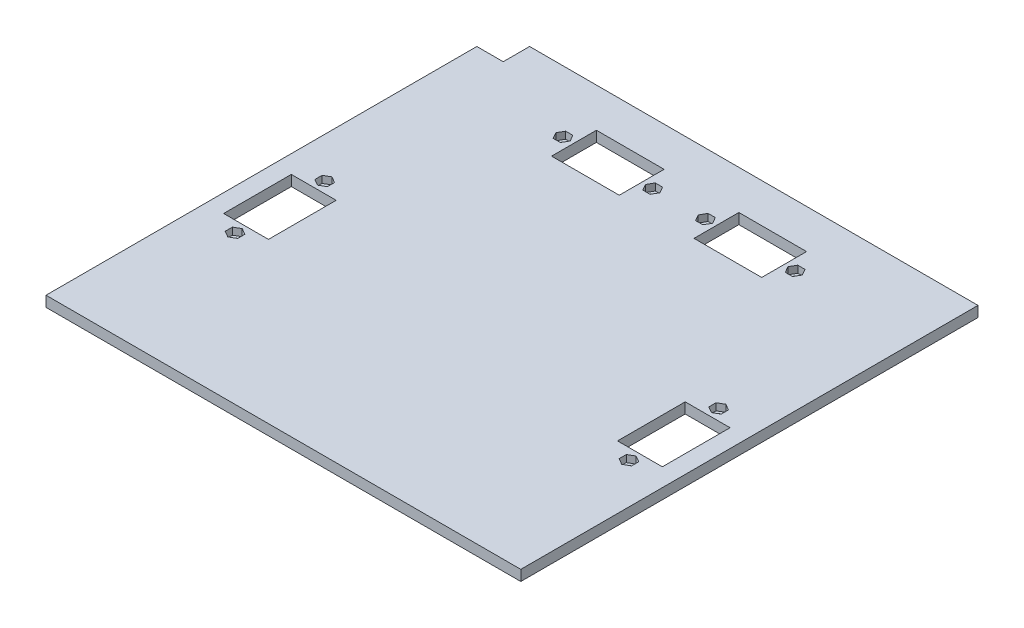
ISO-10303-21;
HEADER;
FILE_DESCRIPTION(('STEP AP214'),'2;1');
FILE_NAME('part.step','',(''),(''),'','','');
FILE_SCHEMA(('AUTOMOTIVE_DESIGN { 1 0 10303 214 1 1 1 1 }'));
ENDSEC;
DATA;
#1=APPLICATION_CONTEXT('core data for automotive mechanical design processes');
#2=APPLICATION_PROTOCOL_DEFINITION('international standard','automotive_design',2000,#1);
#3=PRODUCT_CONTEXT('',#1,'mechanical');
#4=PRODUCT('Part','Part','',(#3));
#5=PRODUCT_RELATED_PRODUCT_CATEGORY('part','',(#4));
#6=PRODUCT_DEFINITION_FORMATION('','',#4);
#7=PRODUCT_DEFINITION_CONTEXT('part definition',#1,'design');
#8=PRODUCT_DEFINITION('design','',#6,#7);
#9=PRODUCT_DEFINITION_SHAPE('','',#8);
#10=(LENGTH_UNIT() NAMED_UNIT(*) SI_UNIT(.MILLI.,.METRE.));
#11=(NAMED_UNIT(*) PLANE_ANGLE_UNIT() SI_UNIT($,.RADIAN.));
#12=(NAMED_UNIT(*) SI_UNIT($,.STERADIAN.) SOLID_ANGLE_UNIT());
#13=UNCERTAINTY_MEASURE_WITH_UNIT(LENGTH_MEASURE(1.E-05),#10,'distance_accuracy_value','');
#14=(GEOMETRIC_REPRESENTATION_CONTEXT(3) GLOBAL_UNCERTAINTY_ASSIGNED_CONTEXT((#13)) GLOBAL_UNIT_ASSIGNED_CONTEXT((#10,
#11,#12)) REPRESENTATION_CONTEXT('',''));
#15=CARTESIAN_POINT('',(0.,0.,0.));
#16=DIRECTION('',(0.,0.,1.));
#17=DIRECTION('',(1.,0.,0.));
#18=AXIS2_PLACEMENT_3D('',#15,#16,#17);
#19=CARTESIAN_POINT('',(65.9999999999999,-4.,-95.));
#20=DIRECTION('',(0.,1.,0.));
#21=DIRECTION('',(0.,0.,1.));
#22=AXIS2_PLACEMENT_3D('',#19,#20,#21);
#23=CYLINDRICAL_SURFACE('',#22,2.);
#24=CARTESIAN_POINT('',(65.9999999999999,0.,-95.));
#25=DIRECTION('',(0.,-1.,0.));
#26=DIRECTION('',(0.,0.,-1.));
#27=AXIS2_PLACEMENT_3D('',#24,#25,#26);
#28=CIRCLE('',#27,2.);
#29=CARTESIAN_POINT('',(65.9999999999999,0.,-97.));
#30=VERTEX_POINT('',#29);
#31=EDGE_CURVE('E526',#30,#30,#28,.T.);
#32=ORIENTED_EDGE('',*,*,#31,.T.);
#33=EDGE_LOOP('',(#32));
#34=FACE_BOUND('',#33,.T.);
#35=CARTESIAN_POINT('',(65.9999999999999,2.,-95.));
#36=DIRECTION('',(0.,1.,0.));
#37=DIRECTION('',(0.,0.,1.));
#38=AXIS2_PLACEMENT_3D('',#35,#36,#37);
#39=CIRCLE('',#38,2.);
#40=CARTESIAN_POINT('',(65.9999999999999,2.,-93.));
#41=VERTEX_POINT('',#40);
#42=EDGE_CURVE('E41',#41,#41,#39,.F.);
#43=ORIENTED_EDGE('',*,*,#42,.F.);
#44=EDGE_LOOP('',(#43));
#45=FACE_BOUND('',#44,.T.);
#46=ADVANCED_FACE('F37',(#34,#45),#23,.F.);
#47=CARTESIAN_POINT('',(15.,-4.,-95.));
#48=DIRECTION('',(0.,1.,0.));
#49=DIRECTION('',(0.,0.,1.));
#50=AXIS2_PLACEMENT_3D('',#47,#48,#49);
#51=CYLINDRICAL_SURFACE('',#50,2.);
#52=CARTESIAN_POINT('',(15.,0.,-95.));
#53=DIRECTION('',(0.,-1.,0.));
#54=DIRECTION('',(0.,0.,-1.));
#55=AXIS2_PLACEMENT_3D('',#52,#53,#54);
#56=CIRCLE('',#55,2.);
#57=CARTESIAN_POINT('',(15.,0.,-97.));
#58=VERTEX_POINT('',#57);
#59=EDGE_CURVE('E529',#58,#58,#56,.T.);
#60=ORIENTED_EDGE('',*,*,#59,.T.);
#61=EDGE_LOOP('',(#60));
#62=FACE_BOUND('',#61,.T.);
#63=CARTESIAN_POINT('',(15.,2.,-95.));
#64=DIRECTION('',(0.,1.,0.));
#65=DIRECTION('',(0.,0.,1.));
#66=AXIS2_PLACEMENT_3D('',#63,#64,#65);
#67=CIRCLE('',#66,2.);
#68=CARTESIAN_POINT('',(15.,2.,-93.));
#69=VERTEX_POINT('',#68);
#70=EDGE_CURVE('E592',#69,#69,#67,.F.);
#71=ORIENTED_EDGE('',*,*,#70,.F.);
#72=EDGE_LOOP('',(#71));
#73=FACE_BOUND('',#72,.T.);
#74=ADVANCED_FACE('F719',(#62,#73),#51,.F.);
#75=CARTESIAN_POINT('',(-15.,-4.,-95.));
#76=DIRECTION('',(0.,1.,0.));
#77=DIRECTION('',(0.,0.,1.));
#78=AXIS2_PLACEMENT_3D('',#75,#76,#77);
#79=CYLINDRICAL_SURFACE('',#78,2.);
#80=CARTESIAN_POINT('',(-15.,0.,-95.));
#81=DIRECTION('',(0.,-1.,0.));
#82=DIRECTION('',(0.,0.,-1.));
#83=AXIS2_PLACEMENT_3D('',#80,#81,#82);
#84=CIRCLE('',#83,2.);
#85=CARTESIAN_POINT('',(-15.,0.,-97.));
#86=VERTEX_POINT('',#85);
#87=EDGE_CURVE('E533',#86,#86,#84,.T.);
#88=ORIENTED_EDGE('',*,*,#87,.T.);
#89=EDGE_LOOP('',(#88));
#90=FACE_BOUND('',#89,.T.);
#91=CARTESIAN_POINT('',(-15.,2.,-95.));
#92=DIRECTION('',(0.,1.,0.));
#93=DIRECTION('',(0.,0.,1.));
#94=AXIS2_PLACEMENT_3D('',#91,#92,#93);
#95=CIRCLE('',#94,2.);
#96=CARTESIAN_POINT('',(-15.,2.,-93.));
#97=VERTEX_POINT('',#96);
#98=EDGE_CURVE('E590',#97,#97,#95,.F.);
#99=ORIENTED_EDGE('',*,*,#98,.F.);
#100=EDGE_LOOP('',(#99));
#101=FACE_BOUND('',#100,.T.);
#102=ADVANCED_FACE('F726',(#90,#101),#79,.F.);
#103=CARTESIAN_POINT('',(112.,-4.,45.5));
#104=DIRECTION('',(0.,1.,0.));
#105=DIRECTION('',(0.,0.,1.));
#106=AXIS2_PLACEMENT_3D('',#103,#104,#105);
#107=CYLINDRICAL_SURFACE('',#106,2.);
#108=CARTESIAN_POINT('',(112.,0.,45.5));
#109=DIRECTION('',(0.,-1.,0.));
#110=DIRECTION('',(0.,0.,-1.));
#111=AXIS2_PLACEMENT_3D('',#108,#109,#110);
#112=CIRCLE('',#111,2.);
#113=CARTESIAN_POINT('',(112.,0.,43.5));
#114=VERTEX_POINT('',#113);
#115=EDGE_CURVE('E545',#114,#114,#112,.T.);
#116=ORIENTED_EDGE('',*,*,#115,.T.);
#117=EDGE_LOOP('',(#116));
#118=FACE_BOUND('',#117,.T.);
#119=CARTESIAN_POINT('',(112.,2.,45.5));
#120=DIRECTION('',(0.,1.,0.));
#121=DIRECTION('',(0.,0.,1.));
#122=AXIS2_PLACEMENT_3D('',#119,#120,#121);
#123=CIRCLE('',#122,2.);
#124=CARTESIAN_POINT('',(112.,2.,47.5));
#125=VERTEX_POINT('',#124);
#126=EDGE_CURVE('E587',#125,#125,#123,.F.);
#127=ORIENTED_EDGE('',*,*,#126,.F.);
#128=EDGE_LOOP('',(#127));
#129=FACE_BOUND('',#128,.T.);
#130=ADVANCED_FACE('F783',(#118,#129),#107,.F.);
#131=CARTESIAN_POINT('',(112.,-4.,-5.50000000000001));
#132=DIRECTION('',(0.,1.,0.));
#133=DIRECTION('',(0.,0.,1.));
#134=AXIS2_PLACEMENT_3D('',#131,#132,#133);
#135=CYLINDRICAL_SURFACE('',#134,2.);
#136=CARTESIAN_POINT('',(112.,0.,-5.50000000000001));
#137=DIRECTION('',(0.,-1.,0.));
#138=DIRECTION('',(0.,0.,-1.));
#139=AXIS2_PLACEMENT_3D('',#136,#137,#138);
#140=CIRCLE('',#139,2.);
#141=CARTESIAN_POINT('',(112.,0.,-7.5));
#142=VERTEX_POINT('',#141);
#143=EDGE_CURVE('E548',#142,#142,#140,.T.);
#144=ORIENTED_EDGE('',*,*,#143,.T.);
#145=EDGE_LOOP('',(#144));
#146=FACE_BOUND('',#145,.T.);
#147=CARTESIAN_POINT('',(112.,2.,-5.50000000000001));
#148=DIRECTION('',(0.,1.,0.));
#149=DIRECTION('',(0.,0.,1.));
#150=AXIS2_PLACEMENT_3D('',#147,#148,#149);
#151=CIRCLE('',#150,2.);
#152=CARTESIAN_POINT('',(112.,2.,-3.50000000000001));
#153=VERTEX_POINT('',#152);
#154=EDGE_CURVE('E584',#153,#153,#151,.F.);
#155=ORIENTED_EDGE('',*,*,#154,.F.);
#156=EDGE_LOOP('',(#155));
#157=FACE_BOUND('',#156,.T.);
#158=ADVANCED_FACE('F763',(#146,#157),#135,.F.);
#159=CARTESIAN_POINT('',(-112.,-4.,-5.50000000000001));
#160=DIRECTION('',(0.,1.,0.));
#161=DIRECTION('',(0.,0.,1.));
#162=AXIS2_PLACEMENT_3D('',#159,#160,#161);
#163=CYLINDRICAL_SURFACE('',#162,2.);
#164=CARTESIAN_POINT('',(-112.,0.,-5.50000000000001));
#165=DIRECTION('',(0.,-1.,0.));
#166=DIRECTION('',(0.,0.,-1.));
#167=AXIS2_PLACEMENT_3D('',#164,#165,#166);
#168=CIRCLE('',#167,2.);
#169=CARTESIAN_POINT('',(-112.,0.,-7.5));
#170=VERTEX_POINT('',#169);
#171=EDGE_CURVE('E560',#170,#170,#168,.T.);
#172=ORIENTED_EDGE('',*,*,#171,.T.);
#173=EDGE_LOOP('',(#172));
#174=FACE_BOUND('',#173,.T.);
#175=CARTESIAN_POINT('',(-112.,2.,-5.50000000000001));
#176=DIRECTION('',(0.,1.,0.));
#177=DIRECTION('',(0.,0.,1.));
#178=AXIS2_PLACEMENT_3D('',#175,#176,#177);
#179=CIRCLE('',#178,2.);
#180=CARTESIAN_POINT('',(-112.,2.,-3.50000000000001));
#181=VERTEX_POINT('',#180);
#182=EDGE_CURVE('E581',#181,#181,#179,.F.);
#183=ORIENTED_EDGE('',*,*,#182,.F.);
#184=EDGE_LOOP('',(#183));
#185=FACE_BOUND('',#184,.T.);
#186=ADVANCED_FACE('F738',(#174,#185),#163,.F.);
#187=CARTESIAN_POINT('',(-112.,-4.,45.5));
#188=DIRECTION('',(0.,1.,0.));
#189=DIRECTION('',(0.,0.,1.));
#190=AXIS2_PLACEMENT_3D('',#187,#188,#189);
#191=CYLINDRICAL_SURFACE('',#190,2.);
#192=CARTESIAN_POINT('',(-112.,0.,45.5));
#193=DIRECTION('',(0.,-1.,0.));
#194=DIRECTION('',(0.,0.,-1.));
#195=AXIS2_PLACEMENT_3D('',#192,#193,#194);
#196=CIRCLE('',#195,2.);
#197=CARTESIAN_POINT('',(-112.,0.,43.5));
#198=VERTEX_POINT('',#197);
#199=EDGE_CURVE('E568',#198,#198,#196,.T.);
#200=ORIENTED_EDGE('',*,*,#199,.T.);
#201=EDGE_LOOP('',(#200));
#202=FACE_BOUND('',#201,.T.);
#203=CARTESIAN_POINT('',(-112.,2.,45.5));
#204=DIRECTION('',(0.,1.,0.));
#205=DIRECTION('',(0.,0.,1.));
#206=AXIS2_PLACEMENT_3D('',#203,#204,#205);
#207=CIRCLE('',#206,2.);
#208=CARTESIAN_POINT('',(-112.,2.,47.5));
#209=VERTEX_POINT('',#208);
#210=EDGE_CURVE('E577',#209,#209,#207,.F.);
#211=ORIENTED_EDGE('',*,*,#210,.F.);
#212=EDGE_LOOP('',(#211));
#213=FACE_BOUND('',#212,.T.);
#214=ADVANCED_FACE('F734',(#202,#213),#191,.F.);
#215=CARTESIAN_POINT('',(-65.9999999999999,-4.,-95.));
#216=DIRECTION('',(0.,1.,0.));
#217=DIRECTION('',(0.,0.,1.));
#218=AXIS2_PLACEMENT_3D('',#215,#216,#217);
#219=CYLINDRICAL_SURFACE('',#218,2.);
#220=CARTESIAN_POINT('',(-65.9999999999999,0.,-95.));
#221=DIRECTION('',(0.,-1.,0.));
#222=DIRECTION('',(0.,0.,-1.));
#223=AXIS2_PLACEMENT_3D('',#220,#221,#222);
#224=CIRCLE('',#223,2.);
#225=CARTESIAN_POINT('',(-65.9999999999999,0.,-97.));
#226=VERTEX_POINT('',#225);
#227=EDGE_CURVE('E571',#226,#226,#224,.T.);
#228=ORIENTED_EDGE('',*,*,#227,.T.);
#229=EDGE_LOOP('',(#228));
#230=FACE_BOUND('',#229,.T.);
#231=CARTESIAN_POINT('',(-65.9999999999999,2.,-95.));
#232=DIRECTION('',(0.,1.,0.));
#233=DIRECTION('',(0.,0.,1.));
#234=AXIS2_PLACEMENT_3D('',#231,#232,#233);
#235=CIRCLE('',#234,2.);
#236=CARTESIAN_POINT('',(-65.9999999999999,2.,-93.));
#237=VERTEX_POINT('',#236);
#238=EDGE_CURVE('E574',#237,#237,#235,.F.);
#239=ORIENTED_EDGE('',*,*,#238,.F.);
#240=EDGE_LOOP('',(#239));
#241=FACE_BOUND('',#240,.T.);
#242=ADVANCED_FACE('F737',(#230,#241),#219,.F.);
#243=CARTESIAN_POINT('',(135.,6.,130.));
#244=DIRECTION('',(-1.,0.,0.));
#245=DIRECTION('',(0.,0.,1.));
#246=AXIS2_PLACEMENT_3D('',#243,#244,#245);
#247=PLANE('',#246);
#248=DIRECTION('',(0.,0.,-1.));
#249=VECTOR('',#248,1.);
#250=CARTESIAN_POINT('',(135.,0.,130.));
#251=LINE('',#250,#249);
#252=CARTESIAN_POINT('',(135.,0.,130.));
#253=VERTEX_POINT('',#252);
#254=CARTESIAN_POINT('',(135.,0.,-130.));
#255=VERTEX_POINT('',#254);
#256=EDGE_CURVE('E503',#253,#255,#251,.T.);
#257=ORIENTED_EDGE('',*,*,#256,.T.);
#258=DIRECTION('',(0.,-1.,0.));
#259=VECTOR('',#258,1.);
#260=CARTESIAN_POINT('',(135.,6.,-130.));
#261=LINE('',#260,#259);
#262=CARTESIAN_POINT('',(135.,6.,-130.));
#263=VERTEX_POINT('',#262);
#264=EDGE_CURVE('E513',#263,#255,#261,.T.);
#265=ORIENTED_EDGE('',*,*,#264,.F.);
#266=DIRECTION('',(0.,0.,-1.));
#267=VECTOR('',#266,1.);
#268=CARTESIAN_POINT('',(135.,6.,130.));
#269=LINE('',#268,#267);
#270=CARTESIAN_POINT('',(135.,6.,130.));
#271=VERTEX_POINT('',#270);
#272=EDGE_CURVE('E500',#271,#263,#269,.T.);
#273=ORIENTED_EDGE('',*,*,#272,.F.);
#274=DIRECTION('',(0.,-1.,0.));
#275=VECTOR('',#274,1.);
#276=CARTESIAN_POINT('',(135.,6.,130.));
#277=LINE('',#276,#275);
#278=EDGE_CURVE('E507',#271,#253,#277,.T.);
#279=ORIENTED_EDGE('',*,*,#278,.T.);
#280=EDGE_LOOP('',(#257,#265,#273,#279));
#281=FACE_BOUND('',#280,.T.);
#282=ADVANCED_FACE('F39',(#281),#247,.F.);
#283=CARTESIAN_POINT('',(-135.,6.,-130.));
#284=DIRECTION('',(0.,0.,1.));
#285=DIRECTION('',(1.,0.,0.));
#286=AXIS2_PLACEMENT_3D('',#283,#284,#285);
#287=PLANE('',#286);
#288=DIRECTION('',(-1.,0.,0.));
#289=VECTOR('',#288,1.);
#290=CARTESIAN_POINT('',(-135.,0.,-130.));
#291=LINE('',#290,#289);
#292=CARTESIAN_POINT('',(-120.,0.,-130.));
#293=VERTEX_POINT('',#292);
#294=EDGE_CURVE('E498',#255,#293,#291,.T.);
#295=ORIENTED_EDGE('',*,*,#294,.T.);
#296=DIRECTION('',(0.,1.,0.));
#297=VECTOR('',#296,1.);
#298=CARTESIAN_POINT('',(-120.,0.,-130.));
#299=LINE('',#298,#297);
#300=CARTESIAN_POINT('',(-120.,6.,-130.));
#301=VERTEX_POINT('',#300);
#302=EDGE_CURVE('E699',#293,#301,#299,.T.);
#303=ORIENTED_EDGE('',*,*,#302,.T.);
#304=DIRECTION('',(-1.,0.,0.));
#305=VECTOR('',#304,1.);
#306=CARTESIAN_POINT('',(-135.,6.,-130.));
#307=LINE('',#306,#305);
#308=EDGE_CURVE('E687',#263,#301,#307,.T.);
#309=ORIENTED_EDGE('',*,*,#308,.F.);
#310=ORIENTED_EDGE('',*,*,#264,.T.);
#311=EDGE_LOOP('',(#295,#303,#309,#310));
#312=FACE_BOUND('',#311,.T.);
#313=ADVANCED_FACE('F698',(#312),#287,.F.);
#314=CARTESIAN_POINT('',(-135.,6.,130.));
#315=DIRECTION('',(1.,0.,0.));
#316=DIRECTION('',(0.,0.,-1.));
#317=AXIS2_PLACEMENT_3D('',#314,#315,#316);
#318=PLANE('',#317);
#319=DIRECTION('',(0.,0.,1.));
#320=VECTOR('',#319,1.);
#321=CARTESIAN_POINT('',(-135.,6.,130.));
#322=LINE('',#321,#320);
#323=CARTESIAN_POINT('',(-135.,6.,-115.));
#324=VERTEX_POINT('',#323);
#325=CARTESIAN_POINT('',(-135.,6.,130.));
#326=VERTEX_POINT('',#325);
#327=EDGE_CURVE('E491',#324,#326,#322,.T.);
#328=ORIENTED_EDGE('',*,*,#327,.F.);
#329=DIRECTION('',(0.,1.,0.));
#330=VECTOR('',#329,1.);
#331=CARTESIAN_POINT('',(-135.,0.,-115.));
#332=LINE('',#331,#330);
#333=CARTESIAN_POINT('',(-135.,0.,-115.));
#334=VERTEX_POINT('',#333);
#335=EDGE_CURVE('E478',#334,#324,#332,.T.);
#336=ORIENTED_EDGE('',*,*,#335,.F.);
#337=DIRECTION('',(0.,0.,1.));
#338=VECTOR('',#337,1.);
#339=CARTESIAN_POINT('',(-135.,0.,130.));
#340=LINE('',#339,#338);
#341=CARTESIAN_POINT('',(-135.,0.,130.));
#342=VERTEX_POINT('',#341);
#343=EDGE_CURVE('E489',#334,#342,#340,.T.);
#344=ORIENTED_EDGE('',*,*,#343,.T.);
#345=DIRECTION('',(0.,-1.,0.));
#346=VECTOR('',#345,1.);
#347=CARTESIAN_POINT('',(-135.,6.,130.));
#348=LINE('',#347,#346);
#349=EDGE_CURVE('E510',#326,#342,#348,.T.);
#350=ORIENTED_EDGE('',*,*,#349,.F.);
#351=EDGE_LOOP('',(#328,#336,#344,#350));
#352=FACE_BOUND('',#351,.T.);
#353=ADVANCED_FACE('F487',(#352),#318,.F.);
#354=CARTESIAN_POINT('',(-135.,6.,130.));
#355=DIRECTION('',(0.,0.,-1.));
#356=DIRECTION('',(-1.,0.,0.));
#357=AXIS2_PLACEMENT_3D('',#354,#355,#356);
#358=PLANE('',#357);
#359=DIRECTION('',(1.,0.,0.));
#360=VECTOR('',#359,1.);
#361=CARTESIAN_POINT('',(-135.,0.,130.));
#362=LINE('',#361,#360);
#363=EDGE_CURVE('E497',#342,#253,#362,.T.);
#364=ORIENTED_EDGE('',*,*,#363,.T.);
#365=ORIENTED_EDGE('',*,*,#278,.F.);
#366=DIRECTION('',(1.,0.,0.));
#367=VECTOR('',#366,1.);
#368=CARTESIAN_POINT('',(-135.,6.,130.));
#369=LINE('',#368,#367);
#370=EDGE_CURVE('E511',#326,#271,#369,.T.);
#371=ORIENTED_EDGE('',*,*,#370,.F.);
#372=ORIENTED_EDGE('',*,*,#349,.T.);
#373=EDGE_LOOP('',(#364,#365,#371,#372));
#374=FACE_BOUND('',#373,.T.);
#375=ADVANCED_FACE('F705',(#374),#358,.F.);
#376=CARTESIAN_POINT('',(0.,6.,0.));
#377=DIRECTION('',(0.,-1.,0.));
#378=DIRECTION('',(0.,0.,-1.));
#379=AXIS2_PLACEMENT_3D('',#376,#377,#378);
#380=PLANE('',#379);
#381=DIRECTION('',(-1.,0.,0.));
#382=VECTOR('',#381,1.);
#383=CARTESIAN_POINT('',(-12.9504065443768,6.,-98.55));
#384=LINE('',#383,#382);
#385=CARTESIAN_POINT('',(-12.9504065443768,6.,-98.55));
#386=VERTEX_POINT('',#385);
#387=CARTESIAN_POINT('',(-17.0495934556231,6.,-98.55));
#388=VERTEX_POINT('',#387);
#389=EDGE_CURVE('E1828',#386,#388,#384,.T.);
#390=ORIENTED_EDGE('',*,*,#389,.F.);
#391=DIRECTION('',(-0.5,0.,-0.866025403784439));
#392=VECTOR('',#391,1.);
#393=CARTESIAN_POINT('',(-10.9008130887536,6.,-95.));
#394=LINE('',#393,#392);
#395=CARTESIAN_POINT('',(-10.9008130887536,6.,-95.));
#396=VERTEX_POINT('',#395);
#397=EDGE_CURVE('E62',#396,#386,#394,.T.);
#398=ORIENTED_EDGE('',*,*,#397,.F.);
#399=DIRECTION('',(0.5,0.,-0.866025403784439));
#400=VECTOR('',#399,1.);
#401=CARTESIAN_POINT('',(-12.9504065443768,6.,-91.45));
#402=LINE('',#401,#400);
#403=CARTESIAN_POINT('',(-12.9504065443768,6.,-91.45));
#404=VERTEX_POINT('',#403);
#405=EDGE_CURVE('E1815',#404,#396,#402,.T.);
#406=ORIENTED_EDGE('',*,*,#405,.F.);
#407=DIRECTION('',(1.,0.,0.));
#408=VECTOR('',#407,1.);
#409=CARTESIAN_POINT('',(-17.0495934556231,6.,-91.45));
#410=LINE('',#409,#408);
#411=CARTESIAN_POINT('',(-17.0495934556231,6.,-91.45));
#412=VERTEX_POINT('',#411);
#413=EDGE_CURVE('E1819',#412,#404,#410,.T.);
#414=ORIENTED_EDGE('',*,*,#413,.F.);
#415=DIRECTION('',(0.5,0.,0.866025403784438));
#416=VECTOR('',#415,1.);
#417=CARTESIAN_POINT('',(-19.0991869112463,6.,-95.));
#418=LINE('',#417,#416);
#419=CARTESIAN_POINT('',(-19.0991869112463,6.,-95.));
#420=VERTEX_POINT('',#419);
#421=EDGE_CURVE('E1822',#420,#412,#418,.T.);
#422=ORIENTED_EDGE('',*,*,#421,.F.);
#423=DIRECTION('',(-0.499999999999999,0.,0.866025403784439));
#424=VECTOR('',#423,1.);
#425=CARTESIAN_POINT('',(-17.0495934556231,6.,-98.55));
#426=LINE('',#425,#424);
#427=EDGE_CURVE('E1825',#388,#420,#426,.T.);
#428=ORIENTED_EDGE('',*,*,#427,.F.);
#429=EDGE_LOOP('',(#390,#398,#406,#414,#422,#428));
#430=FACE_BOUND('',#429,.T.);
#431=DIRECTION('',(-0.5,0.,0.866025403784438));
#432=VECTOR('',#431,1.);
#433=CARTESIAN_POINT('',(12.9504065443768,6.,-98.55));
#434=LINE('',#433,#432);
#435=CARTESIAN_POINT('',(12.9504065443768,6.,-98.55));
#436=VERTEX_POINT('',#435);
#437=CARTESIAN_POINT('',(10.9008130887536,6.,-95.));
#438=VERTEX_POINT('',#437);
#439=EDGE_CURVE('E1783',#436,#438,#434,.T.);
#440=ORIENTED_EDGE('',*,*,#439,.F.);
#441=DIRECTION('',(-1.,0.,0.));
#442=VECTOR('',#441,1.);
#443=CARTESIAN_POINT('',(17.0495934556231,6.,-98.55));
#444=LINE('',#443,#442);
#445=CARTESIAN_POINT('',(17.0495934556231,6.,-98.55));
#446=VERTEX_POINT('',#445);
#447=EDGE_CURVE('E1722',#446,#436,#444,.T.);
#448=ORIENTED_EDGE('',*,*,#447,.F.);
#449=DIRECTION('',(-0.5,0.,-0.866025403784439));
#450=VECTOR('',#449,1.);
#451=CARTESIAN_POINT('',(19.0991869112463,6.,-95.));
#452=LINE('',#451,#450);
#453=CARTESIAN_POINT('',(19.0991869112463,6.,-95.));
#454=VERTEX_POINT('',#453);
#455=EDGE_CURVE('E1770',#454,#446,#452,.T.);
#456=ORIENTED_EDGE('',*,*,#455,.F.);
#457=DIRECTION('',(0.5,0.,-0.866025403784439));
#458=VECTOR('',#457,1.);
#459=CARTESIAN_POINT('',(17.0495934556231,6.,-91.45));
#460=LINE('',#459,#458);
#461=CARTESIAN_POINT('',(17.0495934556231,6.,-91.45));
#462=VERTEX_POINT('',#461);
#463=EDGE_CURVE('E1774',#462,#454,#460,.T.);
#464=ORIENTED_EDGE('',*,*,#463,.F.);
#465=DIRECTION('',(1.,0.,0.));
#466=VECTOR('',#465,1.);
#467=CARTESIAN_POINT('',(12.9504065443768,6.,-91.45));
#468=LINE('',#467,#466);
#469=CARTESIAN_POINT('',(12.9504065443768,6.,-91.45));
#470=VERTEX_POINT('',#469);
#471=EDGE_CURVE('E1777',#470,#462,#468,.T.);
#472=ORIENTED_EDGE('',*,*,#471,.F.);
#473=DIRECTION('',(0.5,0.,0.866025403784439));
#474=VECTOR('',#473,1.);
#475=CARTESIAN_POINT('',(10.9008130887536,6.,-95.));
#476=LINE('',#475,#474);
#477=EDGE_CURVE('E1780',#438,#470,#476,.T.);
#478=ORIENTED_EDGE('',*,*,#477,.F.);
#479=EDGE_LOOP('',(#440,#448,#456,#464,#472,#478));
#480=FACE_BOUND('',#479,.T.);
#481=DIRECTION('',(-0.499999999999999,0.,0.866025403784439));
#482=VECTOR('',#481,1.);
#483=CARTESIAN_POINT('',(63.9504065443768,6.,-98.55));
#484=LINE('',#483,#482);
#485=CARTESIAN_POINT('',(63.9504065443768,6.,-98.55));
#486=VERTEX_POINT('',#485);
#487=CARTESIAN_POINT('',(61.9008130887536,6.,-95.));
#488=VERTEX_POINT('',#487);
#489=EDGE_CURVE('E1736',#486,#488,#484,.T.);
#490=ORIENTED_EDGE('',*,*,#489,.F.);
#491=DIRECTION('',(-1.,0.,0.));
#492=VECTOR('',#491,1.);
#493=CARTESIAN_POINT('',(68.0495934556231,6.,-98.55));
#494=LINE('',#493,#492);
#495=CARTESIAN_POINT('',(68.0495934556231,6.,-98.55));
#496=VERTEX_POINT('',#495);
#497=EDGE_CURVE('E1672',#496,#486,#494,.T.);
#498=ORIENTED_EDGE('',*,*,#497,.F.);
#499=DIRECTION('',(-0.5,0.,-0.866025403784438));
#500=VECTOR('',#499,1.);
#501=CARTESIAN_POINT('',(70.0991869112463,6.,-95.));
#502=LINE('',#501,#500);
#503=CARTESIAN_POINT('',(70.0991869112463,6.,-95.));
#504=VERTEX_POINT('',#503);
#505=EDGE_CURVE('E1723',#504,#496,#502,.T.);
#506=ORIENTED_EDGE('',*,*,#505,.F.);
#507=DIRECTION('',(0.500000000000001,0.,-0.866025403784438));
#508=VECTOR('',#507,1.);
#509=CARTESIAN_POINT('',(68.0495934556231,6.,-91.45));
#510=LINE('',#509,#508);
#511=CARTESIAN_POINT('',(68.0495934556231,6.,-91.45));
#512=VERTEX_POINT('',#511);
#513=EDGE_CURVE('E1727',#512,#504,#510,.T.);
#514=ORIENTED_EDGE('',*,*,#513,.F.);
#515=DIRECTION('',(1.,0.,0.));
#516=VECTOR('',#515,1.);
#517=CARTESIAN_POINT('',(63.9504065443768,6.,-91.45));
#518=LINE('',#517,#516);
#519=CARTESIAN_POINT('',(63.9504065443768,6.,-91.45));
#520=VERTEX_POINT('',#519);
#521=EDGE_CURVE('E1730',#520,#512,#518,.T.);
#522=ORIENTED_EDGE('',*,*,#521,.F.);
#523=DIRECTION('',(0.499999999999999,0.,0.866025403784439));
#524=VECTOR('',#523,1.);
#525=CARTESIAN_POINT('',(61.9008130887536,6.,-95.));
#526=LINE('',#525,#524);
#527=EDGE_CURVE('E1733',#488,#520,#526,.T.);
#528=ORIENTED_EDGE('',*,*,#527,.F.);
#529=EDGE_LOOP('',(#490,#498,#506,#514,#522,#528));
#530=FACE_BOUND('',#529,.T.);
#531=DIRECTION('',(-0.866025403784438,0.,-0.500000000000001));
#532=VECTOR('',#531,1.);
#533=CARTESIAN_POINT('',(115.55,6.,-7.54959345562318));
#534=LINE('',#533,#532);
#535=CARTESIAN_POINT('',(115.55,6.,-7.54959345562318));
#536=VERTEX_POINT('',#535);
#537=CARTESIAN_POINT('',(112.,6.,-9.59918691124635));
#538=VERTEX_POINT('',#537);
#539=EDGE_CURVE('E1686',#536,#538,#534,.T.);
#540=ORIENTED_EDGE('',*,*,#539,.F.);
#541=DIRECTION('',(0.,0.,-1.));
#542=VECTOR('',#541,1.);
#543=CARTESIAN_POINT('',(115.55,6.,-3.45040654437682));
#544=LINE('',#543,#542);
#545=CARTESIAN_POINT('',(115.55,6.,-3.45040654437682));
#546=VERTEX_POINT('',#545);
#547=EDGE_CURVE('E1689',#546,#536,#544,.T.);
#548=ORIENTED_EDGE('',*,*,#547,.F.);
#549=DIRECTION('',(0.866025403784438,0.,-0.500000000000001));
#550=VECTOR('',#549,1.);
#551=CARTESIAN_POINT('',(112.,6.,-1.40081308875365));
#552=LINE('',#551,#550);
#553=CARTESIAN_POINT('',(112.,6.,-1.40081308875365));
#554=VERTEX_POINT('',#553);
#555=EDGE_CURVE('E1673',#554,#546,#552,.T.);
#556=ORIENTED_EDGE('',*,*,#555,.F.);
#557=DIRECTION('',(0.866025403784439,0.,0.499999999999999));
#558=VECTOR('',#557,1.);
#559=CARTESIAN_POINT('',(108.45,6.,-3.45040654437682));
#560=LINE('',#559,#558);
#561=CARTESIAN_POINT('',(108.45,6.,-3.45040654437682));
#562=VERTEX_POINT('',#561);
#563=EDGE_CURVE('E1677',#562,#554,#560,.T.);
#564=ORIENTED_EDGE('',*,*,#563,.F.);
#565=DIRECTION('',(0.,0.,1.));
#566=VECTOR('',#565,1.);
#567=CARTESIAN_POINT('',(108.45,6.,-7.54959345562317));
#568=LINE('',#567,#566);
#569=CARTESIAN_POINT('',(108.45,6.,-7.54959345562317));
#570=VERTEX_POINT('',#569);
#571=EDGE_CURVE('E1680',#570,#562,#568,.T.);
#572=ORIENTED_EDGE('',*,*,#571,.F.);
#573=DIRECTION('',(-0.866025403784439,0.,0.5));
#574=VECTOR('',#573,1.);
#575=CARTESIAN_POINT('',(112.,6.,-9.59918691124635));
#576=LINE('',#575,#574);
#577=EDGE_CURVE('E1683',#538,#570,#576,.T.);
#578=ORIENTED_EDGE('',*,*,#577,.F.);
#579=EDGE_LOOP('',(#540,#548,#556,#564,#572,#578));
#580=FACE_BOUND('',#579,.T.);
#581=DIRECTION('',(-0.866025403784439,0.,-0.499999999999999));
#582=VECTOR('',#581,1.);
#583=CARTESIAN_POINT('',(-108.45,6.,43.4504065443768));
#584=LINE('',#583,#582);
#585=CARTESIAN_POINT('',(-108.45,6.,43.4504065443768));
#586=VERTEX_POINT('',#585);
#587=CARTESIAN_POINT('',(-112.,6.,41.4008130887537));
#588=VERTEX_POINT('',#587);
#589=EDGE_CURVE('E1970',#586,#588,#584,.T.);
#590=ORIENTED_EDGE('',*,*,#589,.F.);
#591=DIRECTION('',(0.,0.,-1.));
#592=VECTOR('',#591,1.);
#593=CARTESIAN_POINT('',(-108.45,6.,47.5495934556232));
#594=LINE('',#593,#592);
#595=CARTESIAN_POINT('',(-108.45,6.,47.5495934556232));
#596=VERTEX_POINT('',#595);
#597=EDGE_CURVE('E1973',#596,#586,#594,.T.);
#598=ORIENTED_EDGE('',*,*,#597,.F.);
#599=DIRECTION('',(0.866025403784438,0.,-0.5));
#600=VECTOR('',#599,1.);
#601=CARTESIAN_POINT('',(-112.,6.,49.5991869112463));
#602=LINE('',#601,#600);
#603=CARTESIAN_POINT('',(-112.,6.,49.5991869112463));
#604=VERTEX_POINT('',#603);
#605=EDGE_CURVE('E1957',#604,#596,#602,.T.);
#606=ORIENTED_EDGE('',*,*,#605,.F.);
#607=DIRECTION('',(0.866025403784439,0.,0.5));
#608=VECTOR('',#607,1.);
#609=CARTESIAN_POINT('',(-115.55,6.,47.5495934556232));
#610=LINE('',#609,#608);
#611=CARTESIAN_POINT('',(-115.55,6.,47.5495934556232));
#612=VERTEX_POINT('',#611);
#613=EDGE_CURVE('E1961',#612,#604,#610,.T.);
#614=ORIENTED_EDGE('',*,*,#613,.F.);
#615=DIRECTION('',(0.,0.,1.));
#616=VECTOR('',#615,1.);
#617=CARTESIAN_POINT('',(-115.55,6.,43.4504065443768));
#618=LINE('',#617,#616);
#619=CARTESIAN_POINT('',(-115.55,6.,43.4504065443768));
#620=VERTEX_POINT('',#619);
#621=EDGE_CURVE('E1964',#620,#612,#618,.T.);
#622=ORIENTED_EDGE('',*,*,#621,.F.);
#623=DIRECTION('',(-0.866025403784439,0.,0.499999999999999));
#624=VECTOR('',#623,1.);
#625=CARTESIAN_POINT('',(-112.,6.,41.4008130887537));
#626=LINE('',#625,#624);
#627=EDGE_CURVE('E1967',#588,#620,#626,.T.);
#628=ORIENTED_EDGE('',*,*,#627,.F.);
#629=EDGE_LOOP('',(#590,#598,#606,#614,#622,#628));
#630=FACE_BOUND('',#629,.T.);
#631=DIRECTION('',(-0.866025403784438,0.,-0.500000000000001));
#632=VECTOR('',#631,1.);
#633=CARTESIAN_POINT('',(-108.45,6.,-7.54959345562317));
#634=LINE('',#633,#632);
#635=CARTESIAN_POINT('',(-108.45,6.,-7.54959345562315));
#636=VERTEX_POINT('',#635);
#637=CARTESIAN_POINT('',(-112.,6.,-9.59918691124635));
#638=VERTEX_POINT('',#637);
#639=EDGE_CURVE('E1876',#636,#638,#634,.T.);
#640=ORIENTED_EDGE('',*,*,#639,.F.);
#641=DIRECTION('',(0.,0.,-1.));
#642=VECTOR('',#641,1.);
#643=CARTESIAN_POINT('',(-108.45,6.,-3.45040654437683));
#644=LINE('',#643,#642);
#645=CARTESIAN_POINT('',(-108.45,6.,-3.45040654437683));
#646=VERTEX_POINT('',#645);
#647=EDGE_CURVE('E1879',#646,#636,#644,.T.);
#648=ORIENTED_EDGE('',*,*,#647,.F.);
#649=DIRECTION('',(0.866025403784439,0.,-0.499999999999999));
#650=VECTOR('',#649,1.);
#651=CARTESIAN_POINT('',(-112.,6.,-1.40081308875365));
#652=LINE('',#651,#650);
#653=CARTESIAN_POINT('',(-112.,6.,-1.40081308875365));
#654=VERTEX_POINT('',#653);
#655=EDGE_CURVE('E1863',#654,#646,#652,.T.);
#656=ORIENTED_EDGE('',*,*,#655,.F.);
#657=DIRECTION('',(0.866025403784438,0.,0.500000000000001));
#658=VECTOR('',#657,1.);
#659=CARTESIAN_POINT('',(-115.55,6.,-3.45040654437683));
#660=LINE('',#659,#658);
#661=CARTESIAN_POINT('',(-115.55,6.,-3.45040654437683));
#662=VERTEX_POINT('',#661);
#663=EDGE_CURVE('E1867',#662,#654,#660,.T.);
#664=ORIENTED_EDGE('',*,*,#663,.F.);
#665=DIRECTION('',(0.,0.,1.));
#666=VECTOR('',#665,1.);
#667=CARTESIAN_POINT('',(-115.55,6.,-7.54959345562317));
#668=LINE('',#667,#666);
#669=CARTESIAN_POINT('',(-115.55,6.,-7.54959345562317));
#670=VERTEX_POINT('',#669);
#671=EDGE_CURVE('E1870',#670,#662,#668,.T.);
#672=ORIENTED_EDGE('',*,*,#671,.F.);
#673=DIRECTION('',(-0.866025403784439,0.,0.499999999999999));
#674=VECTOR('',#673,1.);
#675=CARTESIAN_POINT('',(-112.,6.,-9.59918691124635));
#676=LINE('',#675,#674);
#677=EDGE_CURVE('E1873',#638,#670,#676,.T.);
#678=ORIENTED_EDGE('',*,*,#677,.F.);
#679=EDGE_LOOP('',(#640,#648,#656,#664,#672,#678));
#680=FACE_BOUND('',#679,.T.);
#681=DIRECTION('',(0.,0.,-1.));
#682=VECTOR('',#681,1.);
#683=CARTESIAN_POINT('',(115.55,6.,47.5495934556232));
#684=LINE('',#683,#682);
#685=CARTESIAN_POINT('',(115.55,6.,47.5495934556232));
#686=VERTEX_POINT('',#685);
#687=CARTESIAN_POINT('',(115.55,6.,43.4504065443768));
#688=VERTEX_POINT('',#687);
#689=EDGE_CURVE('E1924',#686,#688,#684,.T.);
#690=ORIENTED_EDGE('',*,*,#689,.F.);
#691=DIRECTION('',(0.866025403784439,0.,-0.499999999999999));
#692=VECTOR('',#691,1.);
#693=CARTESIAN_POINT('',(112.,6.,49.5991869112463));
#694=LINE('',#693,#692);
#695=CARTESIAN_POINT('',(112.,6.,49.5991869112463));
#696=VERTEX_POINT('',#695);
#697=EDGE_CURVE('E1862',#696,#686,#694,.T.);
#698=ORIENTED_EDGE('',*,*,#697,.F.);
#699=DIRECTION('',(0.866025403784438,0.,0.5));
#700=VECTOR('',#699,1.);
#701=CARTESIAN_POINT('',(108.45,6.,47.5495934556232));
#702=LINE('',#701,#700);
#703=CARTESIAN_POINT('',(108.45,6.,47.5495934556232));
#704=VERTEX_POINT('',#703);
#705=EDGE_CURVE('E1911',#704,#696,#702,.T.);
#706=ORIENTED_EDGE('',*,*,#705,.F.);
#707=DIRECTION('',(0.,0.,1.));
#708=VECTOR('',#707,1.);
#709=CARTESIAN_POINT('',(108.45,6.,43.4504065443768));
#710=LINE('',#709,#708);
#711=CARTESIAN_POINT('',(108.45,6.,43.4504065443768));
#712=VERTEX_POINT('',#711);
#713=EDGE_CURVE('E1915',#712,#704,#710,.T.);
#714=ORIENTED_EDGE('',*,*,#713,.F.);
#715=DIRECTION('',(-0.866025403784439,0.,0.499999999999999));
#716=VECTOR('',#715,1.);
#717=CARTESIAN_POINT('',(112.,6.,41.4008130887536));
#718=LINE('',#717,#716);
#719=CARTESIAN_POINT('',(112.,6.,41.4008130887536));
#720=VERTEX_POINT('',#719);
#721=EDGE_CURVE('E1918',#720,#712,#718,.T.);
#722=ORIENTED_EDGE('',*,*,#721,.F.);
#723=DIRECTION('',(-0.866025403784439,0.,-0.499999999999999));
#724=VECTOR('',#723,1.);
#725=CARTESIAN_POINT('',(115.55,6.,43.4504065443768));
#726=LINE('',#725,#724);
#727=EDGE_CURVE('E1921',#688,#720,#726,.T.);
#728=ORIENTED_EDGE('',*,*,#727,.F.);
#729=EDGE_LOOP('',(#690,#698,#706,#714,#722,#728));
#730=FACE_BOUND('',#729,.T.);
#731=DIRECTION('',(-0.500000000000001,0.,0.866025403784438));
#732=VECTOR('',#731,1.);
#733=CARTESIAN_POINT('',(-68.0495934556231,6.,-98.55));
#734=LINE('',#733,#732);
#735=CARTESIAN_POINT('',(-68.0495934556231,6.,-98.55));
#736=VERTEX_POINT('',#735);
#737=CARTESIAN_POINT('',(-70.0991869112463,6.,-95.));
#738=VERTEX_POINT('',#737);
#739=EDGE_CURVE('E1606',#736,#738,#734,.T.);
#740=ORIENTED_EDGE('',*,*,#739,.F.);
#741=DIRECTION('',(-1.,0.,0.));
#742=VECTOR('',#741,1.);
#743=CARTESIAN_POINT('',(-63.9504065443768,6.,-98.55));
#744=LINE('',#743,#742);
#745=CARTESIAN_POINT('',(-63.9504065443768,6.,-98.55));
#746=VERTEX_POINT('',#745);
#747=EDGE_CURVE('E1598',#746,#736,#744,.T.);
#748=ORIENTED_EDGE('',*,*,#747,.F.);
#749=DIRECTION('',(-0.5,0.,-0.866025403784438));
#750=VECTOR('',#749,1.);
#751=CARTESIAN_POINT('',(-61.9008130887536,6.,-94.9999999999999));
#752=LINE('',#751,#750);
#753=CARTESIAN_POINT('',(-61.9008130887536,6.,-94.9999999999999));
#754=VERTEX_POINT('',#753);
#755=EDGE_CURVE('E1630',#754,#746,#752,.T.);
#756=ORIENTED_EDGE('',*,*,#755,.F.);
#757=DIRECTION('',(0.499999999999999,0.,-0.866025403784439));
#758=VECTOR('',#757,1.);
#759=CARTESIAN_POINT('',(-63.9504065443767,6.,-91.4499999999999));
#760=LINE('',#759,#758);
#761=CARTESIAN_POINT('',(-63.9504065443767,6.,-91.4499999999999));
#762=VERTEX_POINT('',#761);
#763=EDGE_CURVE('E1627',#762,#754,#760,.T.);
#764=ORIENTED_EDGE('',*,*,#763,.F.);
#765=DIRECTION('',(1.,0.,0.));
#766=VECTOR('',#765,1.);
#767=CARTESIAN_POINT('',(-68.0495934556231,6.,-91.4499999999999));
#768=LINE('',#767,#766);
#769=CARTESIAN_POINT('',(-68.0495934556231,6.,-91.4499999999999));
#770=VERTEX_POINT('',#769);
#771=EDGE_CURVE('E1621',#770,#762,#768,.T.);
#772=ORIENTED_EDGE('',*,*,#771,.F.);
#773=DIRECTION('',(0.500000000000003,0.,0.866025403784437));
#774=VECTOR('',#773,1.);
#775=CARTESIAN_POINT('',(-70.0991869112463,6.,-95.));
#776=LINE('',#775,#774);
#777=EDGE_CURVE('E1619',#738,#770,#776,.T.);
#778=ORIENTED_EDGE('',*,*,#777,.F.);
#779=EDGE_LOOP('',(#740,#748,#756,#764,#772,#778));
#780=FACE_BOUND('',#779,.T.);
#781=DIRECTION('',(-1.,0.,0.));
#782=VECTOR('',#781,1.);
#783=CARTESIAN_POINT('',(-59.75,6.,-107.75));
#784=LINE('',#783,#782);
#785=CARTESIAN_POINT('',(-21.25,6.,-107.75));
#786=VERTEX_POINT('',#785);
#787=CARTESIAN_POINT('',(-59.75,6.,-107.75));
#788=VERTEX_POINT('',#787);
#789=EDGE_CURVE('E629',#786,#788,#784,.T.);
#790=ORIENTED_EDGE('',*,*,#789,.F.);
#791=DIRECTION('',(0.,0.,-1.));
#792=VECTOR('',#791,1.);
#793=CARTESIAN_POINT('',(-21.25,6.,-107.75));
#794=LINE('',#793,#792);
#795=CARTESIAN_POINT('',(-21.25,6.,-82.25));
#796=VERTEX_POINT('',#795);
#797=EDGE_CURVE('E627',#796,#786,#794,.T.);
#798=ORIENTED_EDGE('',*,*,#797,.F.);
#799=DIRECTION('',(1.,0.,0.));
#800=VECTOR('',#799,1.);
#801=CARTESIAN_POINT('',(-59.75,6.,-82.25));
#802=LINE('',#801,#800);
#803=CARTESIAN_POINT('',(-59.75,6.,-82.25));
#804=VERTEX_POINT('',#803);
#805=EDGE_CURVE('E636',#804,#796,#802,.T.);
#806=ORIENTED_EDGE('',*,*,#805,.F.);
#807=DIRECTION('',(0.,0.,1.));
#808=VECTOR('',#807,1.);
#809=CARTESIAN_POINT('',(-59.75,6.,-107.75));
#810=LINE('',#809,#808);
#811=EDGE_CURVE('E633',#788,#804,#810,.T.);
#812=ORIENTED_EDGE('',*,*,#811,.F.);
#813=EDGE_LOOP('',(#790,#798,#806,#812));
#814=FACE_BOUND('',#813,.T.);
#815=DIRECTION('',(-1.,0.,0.));
#816=VECTOR('',#815,1.);
#817=CARTESIAN_POINT('',(124.75,6.,0.749999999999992));
#818=LINE('',#817,#816);
#819=CARTESIAN_POINT('',(124.75,6.,0.749999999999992));
#820=VERTEX_POINT('',#819);
#821=CARTESIAN_POINT('',(99.25,6.,0.749999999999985));
#822=VERTEX_POINT('',#821);
#823=EDGE_CURVE('E650',#820,#822,#818,.T.);
#824=ORIENTED_EDGE('',*,*,#823,.F.);
#825=DIRECTION('',(0.,0.,-1.));
#826=VECTOR('',#825,1.);
#827=CARTESIAN_POINT('',(124.75,6.,39.25));
#828=LINE('',#827,#826);
#829=CARTESIAN_POINT('',(124.75,6.,39.25));
#830=VERTEX_POINT('',#829);
#831=EDGE_CURVE('E621',#830,#820,#828,.T.);
#832=ORIENTED_EDGE('',*,*,#831,.F.);
#833=DIRECTION('',(1.,0.,0.));
#834=VECTOR('',#833,1.);
#835=CARTESIAN_POINT('',(124.75,6.,39.25));
#836=LINE('',#835,#834);
#837=CARTESIAN_POINT('',(99.25,6.,39.25));
#838=VERTEX_POINT('',#837);
#839=EDGE_CURVE('E656',#838,#830,#836,.T.);
#840=ORIENTED_EDGE('',*,*,#839,.F.);
#841=DIRECTION('',(0.,0.,1.));
#842=VECTOR('',#841,1.);
#843=CARTESIAN_POINT('',(99.25,6.,39.25));
#844=LINE('',#843,#842);
#845=EDGE_CURVE('E653',#822,#838,#844,.T.);
#846=ORIENTED_EDGE('',*,*,#845,.F.);
#847=EDGE_LOOP('',(#824,#832,#840,#846));
#848=FACE_BOUND('',#847,.T.);
#849=DIRECTION('',(-1.,0.,0.));
#850=VECTOR('',#849,1.);
#851=CARTESIAN_POINT('',(59.75,6.,-107.75));
#852=LINE('',#851,#850);
#853=CARTESIAN_POINT('',(59.75,6.,-107.75));
#854=VERTEX_POINT('',#853);
#855=CARTESIAN_POINT('',(21.25,6.,-107.75));
#856=VERTEX_POINT('',#855);
#857=EDGE_CURVE('E600',#854,#856,#852,.T.);
#858=ORIENTED_EDGE('',*,*,#857,.F.);
#859=DIRECTION('',(0.,0.,-1.));
#860=VECTOR('',#859,1.);
#861=CARTESIAN_POINT('',(59.75,6.,-107.75));
#862=LINE('',#861,#860);
#863=CARTESIAN_POINT('',(59.75,6.,-82.25));
#864=VERTEX_POINT('',#863);
#865=EDGE_CURVE('E597',#864,#854,#862,.T.);
#866=ORIENTED_EDGE('',*,*,#865,.F.);
#867=DIRECTION('',(1.,0.,0.));
#868=VECTOR('',#867,1.);
#869=CARTESIAN_POINT('',(59.75,6.,-82.25));
#870=LINE('',#869,#868);
#871=CARTESIAN_POINT('',(21.25,6.,-82.25));
#872=VERTEX_POINT('',#871);
#873=EDGE_CURVE('E615',#872,#864,#870,.T.);
#874=ORIENTED_EDGE('',*,*,#873,.F.);
#875=DIRECTION('',(0.,0.,1.));
#876=VECTOR('',#875,1.);
#877=CARTESIAN_POINT('',(21.25,6.,-107.75));
#878=LINE('',#877,#876);
#879=EDGE_CURVE('E607',#856,#872,#878,.T.);
#880=ORIENTED_EDGE('',*,*,#879,.F.);
#881=EDGE_LOOP('',(#858,#866,#874,#880));
#882=FACE_BOUND('',#881,.T.);
#883=DIRECTION('',(-1.,0.,0.));
#884=VECTOR('',#883,1.);
#885=CARTESIAN_POINT('',(-124.75,6.,0.749999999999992));
#886=LINE('',#885,#884);
#887=CARTESIAN_POINT('',(-99.25,6.,0.749999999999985));
#888=VERTEX_POINT('',#887);
#889=CARTESIAN_POINT('',(-124.75,6.,0.749999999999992));
#890=VERTEX_POINT('',#889);
#891=EDGE_CURVE('E668',#888,#890,#886,.T.);
#892=ORIENTED_EDGE('',*,*,#891,.F.);
#893=DIRECTION('',(0.,0.,-1.));
#894=VECTOR('',#893,1.);
#895=CARTESIAN_POINT('',(-99.25,6.,39.25));
#896=LINE('',#895,#894);
#897=CARTESIAN_POINT('',(-99.25,6.,39.25));
#898=VERTEX_POINT('',#897);
#899=EDGE_CURVE('E642',#898,#888,#896,.T.);
#900=ORIENTED_EDGE('',*,*,#899,.F.);
#901=DIRECTION('',(1.,0.,0.));
#902=VECTOR('',#901,1.);
#903=CARTESIAN_POINT('',(-124.75,6.,39.25));
#904=LINE('',#903,#902);
#905=CARTESIAN_POINT('',(-124.75,6.,39.25));
#906=VERTEX_POINT('',#905);
#907=EDGE_CURVE('E674',#906,#898,#904,.T.);
#908=ORIENTED_EDGE('',*,*,#907,.F.);
#909=DIRECTION('',(0.,0.,1.));
#910=VECTOR('',#909,1.);
#911=CARTESIAN_POINT('',(-124.75,6.,39.25));
#912=LINE('',#911,#910);
#913=EDGE_CURVE('E671',#890,#906,#912,.T.);
#914=ORIENTED_EDGE('',*,*,#913,.F.);
#915=EDGE_LOOP('',(#892,#900,#908,#914));
#916=FACE_BOUND('',#915,.T.);
#917=ORIENTED_EDGE('',*,*,#308,.T.);
#918=DIRECTION('',(0.,0.,-1.));
#919=VECTOR('',#918,1.);
#920=CARTESIAN_POINT('',(-120.,6.,-130.));
#921=LINE('',#920,#919);
#922=CARTESIAN_POINT('',(-120.,6.,-115.));
#923=VERTEX_POINT('',#922);
#924=EDGE_CURVE('E483',#923,#301,#921,.T.);
#925=ORIENTED_EDGE('',*,*,#924,.F.);
#926=DIRECTION('',(1.,0.,0.));
#927=VECTOR('',#926,1.);
#928=CARTESIAN_POINT('',(-135.,6.,-115.));
#929=LINE('',#928,#927);
#930=EDGE_CURVE('E1994',#324,#923,#929,.T.);
#931=ORIENTED_EDGE('',*,*,#930,.F.);
#932=ORIENTED_EDGE('',*,*,#327,.T.);
#933=ORIENTED_EDGE('',*,*,#370,.T.);
#934=ORIENTED_EDGE('',*,*,#272,.T.);
#935=EDGE_LOOP('',(#917,#925,#931,#932,#933,#934));
#936=FACE_BOUND('',#935,.T.);
#937=ADVANCED_FACE('F702',(#430,#480,#530,#580,#630,#680,#730,#780,#814,#848,#882,#916,#936),
#380,.F.);
#938=CARTESIAN_POINT('',(0.,0.,0.));
#939=DIRECTION('',(0.,-1.,0.));
#940=DIRECTION('',(0.,0.,-1.));
#941=AXIS2_PLACEMENT_3D('',#938,#939,#940);
#942=PLANE('',#941);
#943=DIRECTION('',(0.,0.,-1.));
#944=VECTOR('',#943,1.);
#945=CARTESIAN_POINT('',(-120.,0.,-130.));
#946=LINE('',#945,#944);
#947=CARTESIAN_POINT('',(-120.,0.,-115.));
#948=VERTEX_POINT('',#947);
#949=EDGE_CURVE('E54',#948,#293,#946,.T.);
#950=ORIENTED_EDGE('',*,*,#949,.T.);
#951=ORIENTED_EDGE('',*,*,#294,.F.);
#952=ORIENTED_EDGE('',*,*,#256,.F.);
#953=ORIENTED_EDGE('',*,*,#363,.F.);
#954=ORIENTED_EDGE('',*,*,#343,.F.);
#955=DIRECTION('',(1.,0.,0.));
#956=VECTOR('',#955,1.);
#957=CARTESIAN_POINT('',(-135.,0.,-115.));
#958=LINE('',#957,#956);
#959=EDGE_CURVE('E474',#334,#948,#958,.T.);
#960=ORIENTED_EDGE('',*,*,#959,.T.);
#961=EDGE_LOOP('',(#950,#951,#952,#953,#954,#960));
#962=FACE_BOUND('',#961,.T.);
#963=ORIENTED_EDGE('',*,*,#227,.F.);
#964=EDGE_LOOP('',(#963));
#965=FACE_BOUND('',#964,.T.);
#966=ORIENTED_EDGE('',*,*,#199,.F.);
#967=EDGE_LOOP('',(#966));
#968=FACE_BOUND('',#967,.T.);
#969=ORIENTED_EDGE('',*,*,#171,.F.);
#970=EDGE_LOOP('',(#969));
#971=FACE_BOUND('',#970,.T.);
#972=DIRECTION('',(0.,0.,1.));
#973=VECTOR('',#972,1.);
#974=CARTESIAN_POINT('',(-21.25,0.,0.));
#975=LINE('',#974,#973);
#976=CARTESIAN_POINT('',(-21.25,0.,-107.75));
#977=VERTEX_POINT('',#976);
#978=CARTESIAN_POINT('',(-21.25,0.,-82.25));
#979=VERTEX_POINT('',#978);
#980=EDGE_CURVE('E11',#977,#979,#975,.T.);
#981=ORIENTED_EDGE('',*,*,#980,.F.);
#982=DIRECTION('',(1.,0.,0.));
#983=VECTOR('',#982,1.);
#984=CARTESIAN_POINT('',(0.,0.,-107.75));
#985=LINE('',#984,#983);
#986=CARTESIAN_POINT('',(-59.75,0.,-107.75));
#987=VERTEX_POINT('',#986);
#988=EDGE_CURVE('E557',#987,#977,#985,.T.);
#989=ORIENTED_EDGE('',*,*,#988,.F.);
#990=DIRECTION('',(0.,0.,-1.));
#991=VECTOR('',#990,1.);
#992=CARTESIAN_POINT('',(-59.75,0.,0.));
#993=LINE('',#992,#991);
#994=CARTESIAN_POINT('',(-59.75,0.,-82.25));
#995=VERTEX_POINT('',#994);
#996=EDGE_CURVE('E562',#995,#987,#993,.T.);
#997=ORIENTED_EDGE('',*,*,#996,.F.);
#998=DIRECTION('',(-1.,0.,0.));
#999=VECTOR('',#998,1.);
#1000=CARTESIAN_POINT('',(0.,0.,-82.25));
#1001=LINE('',#1000,#999);
#1002=EDGE_CURVE('E46',#979,#995,#1001,.T.);
#1003=ORIENTED_EDGE('',*,*,#1002,.F.);
#1004=EDGE_LOOP('',(#981,#989,#997,#1003));
#1005=FACE_BOUND('',#1004,.T.);
#1006=ORIENTED_EDGE('',*,*,#143,.F.);
#1007=EDGE_LOOP('',(#1006));
#1008=FACE_BOUND('',#1007,.T.);
#1009=DIRECTION('',(0.,0.,1.));
#1010=VECTOR('',#1009,1.);
#1011=CARTESIAN_POINT('',(124.75,0.,0.));
#1012=LINE('',#1011,#1010);
#1013=CARTESIAN_POINT('',(124.75,0.,0.749999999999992));
#1014=VERTEX_POINT('',#1013);
#1015=CARTESIAN_POINT('',(124.75,0.,39.25));
#1016=VERTEX_POINT('',#1015);
#1017=EDGE_CURVE('E555',#1014,#1016,#1012,.T.);
#1018=ORIENTED_EDGE('',*,*,#1017,.F.);
#1019=DIRECTION('',(1.,0.,0.));
#1020=VECTOR('',#1019,1.);
#1021=CARTESIAN_POINT('',(0.,0.,0.74999999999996));
#1022=LINE('',#1021,#1020);
#1023=CARTESIAN_POINT('',(99.25,0.,0.749999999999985));
#1024=VERTEX_POINT('',#1023);
#1025=EDGE_CURVE('E542',#1024,#1014,#1022,.T.);
#1026=ORIENTED_EDGE('',*,*,#1025,.F.);
#1027=DIRECTION('',(0.,0.,-1.));
#1028=VECTOR('',#1027,1.);
#1029=CARTESIAN_POINT('',(99.25,0.,0.));
#1030=LINE('',#1029,#1028);
#1031=CARTESIAN_POINT('',(99.25,0.,39.25));
#1032=VERTEX_POINT('',#1031);
#1033=EDGE_CURVE('E550',#1032,#1024,#1030,.T.);
#1034=ORIENTED_EDGE('',*,*,#1033,.F.);
#1035=DIRECTION('',(-1.,0.,0.));
#1036=VECTOR('',#1035,1.);
#1037=CARTESIAN_POINT('',(0.,0.,39.25));
#1038=LINE('',#1037,#1036);
#1039=EDGE_CURVE('E553',#1016,#1032,#1038,.T.);
#1040=ORIENTED_EDGE('',*,*,#1039,.F.);
#1041=EDGE_LOOP('',(#1018,#1026,#1034,#1040));
#1042=FACE_BOUND('',#1041,.T.);
#1043=ORIENTED_EDGE('',*,*,#115,.F.);
#1044=EDGE_LOOP('',(#1043));
#1045=FACE_BOUND('',#1044,.T.);
#1046=ORIENTED_EDGE('',*,*,#87,.F.);
#1047=EDGE_LOOP('',(#1046));
#1048=FACE_BOUND('',#1047,.T.);
#1049=DIRECTION('',(0.,0.,1.));
#1050=VECTOR('',#1049,1.);
#1051=CARTESIAN_POINT('',(59.75,0.,0.));
#1052=LINE('',#1051,#1050);
#1053=CARTESIAN_POINT('',(59.75,0.,-107.75));
#1054=VERTEX_POINT('',#1053);
#1055=CARTESIAN_POINT('',(59.75,0.,-82.25));
#1056=VERTEX_POINT('',#1055);
#1057=EDGE_CURVE('E540',#1054,#1056,#1052,.T.);
#1058=ORIENTED_EDGE('',*,*,#1057,.F.);
#1059=DIRECTION('',(1.,0.,0.));
#1060=VECTOR('',#1059,1.);
#1061=CARTESIAN_POINT('',(0.,0.,-107.75));
#1062=LINE('',#1061,#1060);
#1063=CARTESIAN_POINT('',(21.25,0.,-107.75));
#1064=VERTEX_POINT('',#1063);
#1065=EDGE_CURVE('E525',#1064,#1054,#1062,.T.);
#1066=ORIENTED_EDGE('',*,*,#1065,.F.);
#1067=DIRECTION('',(0.,0.,-1.));
#1068=VECTOR('',#1067,1.);
#1069=CARTESIAN_POINT('',(21.25,0.,0.));
#1070=LINE('',#1069,#1068);
#1071=CARTESIAN_POINT('',(21.25,0.,-82.25));
#1072=VERTEX_POINT('',#1071);
#1073=EDGE_CURVE('E535',#1072,#1064,#1070,.T.);
#1074=ORIENTED_EDGE('',*,*,#1073,.F.);
#1075=DIRECTION('',(-1.,0.,0.));
#1076=VECTOR('',#1075,1.);
#1077=CARTESIAN_POINT('',(0.,0.,-82.25));
#1078=LINE('',#1077,#1076);
#1079=EDGE_CURVE('E538',#1056,#1072,#1078,.T.);
#1080=ORIENTED_EDGE('',*,*,#1079,.F.);
#1081=EDGE_LOOP('',(#1058,#1066,#1074,#1080));
#1082=FACE_BOUND('',#1081,.T.);
#1083=ORIENTED_EDGE('',*,*,#59,.F.);
#1084=EDGE_LOOP('',(#1083));
#1085=FACE_BOUND('',#1084,.T.);
#1086=ORIENTED_EDGE('',*,*,#31,.F.);
#1087=EDGE_LOOP('',(#1086));
#1088=FACE_BOUND('',#1087,.T.);
#1089=DIRECTION('',(0.,0.,1.));
#1090=VECTOR('',#1089,1.);
#1091=CARTESIAN_POINT('',(-99.25,0.,0.));
#1092=LINE('',#1091,#1090);
#1093=CARTESIAN_POINT('',(-99.25,0.,0.749999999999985));
#1094=VERTEX_POINT('',#1093);
#1095=CARTESIAN_POINT('',(-99.25,0.,39.25));
#1096=VERTEX_POINT('',#1095);
#1097=EDGE_CURVE('E523',#1094,#1096,#1092,.T.);
#1098=ORIENTED_EDGE('',*,*,#1097,.F.);
#1099=DIRECTION('',(1.,0.,0.));
#1100=VECTOR('',#1099,1.);
#1101=CARTESIAN_POINT('',(0.,0.,0.74999999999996));
#1102=LINE('',#1101,#1100);
#1103=CARTESIAN_POINT('',(-124.75,0.,0.749999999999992));
#1104=VERTEX_POINT('',#1103);
#1105=EDGE_CURVE('E516',#1104,#1094,#1102,.T.);
#1106=ORIENTED_EDGE('',*,*,#1105,.F.);
#1107=DIRECTION('',(0.,0.,-1.));
#1108=VECTOR('',#1107,1.);
#1109=CARTESIAN_POINT('',(-124.75,0.,0.));
#1110=LINE('',#1109,#1108);
#1111=CARTESIAN_POINT('',(-124.75,0.,39.25));
#1112=VERTEX_POINT('',#1111);
#1113=EDGE_CURVE('E518',#1112,#1104,#1110,.T.);
#1114=ORIENTED_EDGE('',*,*,#1113,.F.);
#1115=DIRECTION('',(-1.,0.,0.));
#1116=VECTOR('',#1115,1.);
#1117=CARTESIAN_POINT('',(0.,0.,39.25));
#1118=LINE('',#1117,#1116);
#1119=EDGE_CURVE('E521',#1096,#1112,#1118,.T.);
#1120=ORIENTED_EDGE('',*,*,#1119,.F.);
#1121=EDGE_LOOP('',(#1098,#1106,#1114,#1120));
#1122=FACE_BOUND('',#1121,.T.);
#1123=ADVANCED_FACE('F494',(#962,#965,#968,#971,#1005,#1008,#1042,#1045,#1048,#1082,#1085,#1088,
#1122),#942,.T.);
#1124=CARTESIAN_POINT('',(-99.25,-4.,39.25));
#1125=DIRECTION('',(1.,0.,0.));
#1126=DIRECTION('',(0.,0.,-1.));
#1127=AXIS2_PLACEMENT_3D('',#1124,#1125,#1126);
#1128=PLANE('',#1127);
#1129=ORIENTED_EDGE('',*,*,#1097,.T.);
#1130=DIRECTION('',(0.,1.,0.));
#1131=VECTOR('',#1130,1.);
#1132=CARTESIAN_POINT('',(-99.25,-4.,39.25));
#1133=LINE('',#1132,#1131);
#1134=EDGE_CURVE('E530',#1096,#898,#1133,.T.);
#1135=ORIENTED_EDGE('',*,*,#1134,.T.);
#1136=ORIENTED_EDGE('',*,*,#899,.T.);
#1137=DIRECTION('',(0.,1.,0.));
#1138=VECTOR('',#1137,1.);
#1139=CARTESIAN_POINT('',(-99.25,-4.,0.749999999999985));
#1140=LINE('',#1139,#1138);
#1141=EDGE_CURVE('E677',#1094,#888,#1140,.T.);
#1142=ORIENTED_EDGE('',*,*,#1141,.F.);
#1143=EDGE_LOOP('',(#1129,#1135,#1136,#1142));
#1144=FACE_BOUND('',#1143,.T.);
#1145=ADVANCED_FACE('F795',(#1144),#1128,.F.);
#1146=CARTESIAN_POINT('',(-124.75,-4.,39.25));
#1147=DIRECTION('',(0.,0.,1.));
#1148=DIRECTION('',(1.,0.,0.));
#1149=AXIS2_PLACEMENT_3D('',#1146,#1147,#1148);
#1150=PLANE('',#1149);
#1151=ORIENTED_EDGE('',*,*,#1119,.T.);
#1152=DIRECTION('',(0.,1.,0.));
#1153=VECTOR('',#1152,1.);
#1154=CARTESIAN_POINT('',(-124.75,-4.,39.25));
#1155=LINE('',#1154,#1153);
#1156=EDGE_CURVE('E679',#1112,#906,#1155,.T.);
#1157=ORIENTED_EDGE('',*,*,#1156,.T.);
#1158=ORIENTED_EDGE('',*,*,#907,.T.);
#1159=ORIENTED_EDGE('',*,*,#1134,.F.);
#1160=EDGE_LOOP('',(#1151,#1157,#1158,#1159));
#1161=FACE_BOUND('',#1160,.T.);
#1162=ADVANCED_FACE('F791',(#1161),#1150,.F.);
#1163=CARTESIAN_POINT('',(-124.75,-4.,39.25));
#1164=DIRECTION('',(-1.,0.,0.));
#1165=DIRECTION('',(0.,0.,1.));
#1166=AXIS2_PLACEMENT_3D('',#1163,#1164,#1165);
#1167=PLANE('',#1166);
#1168=ORIENTED_EDGE('',*,*,#1113,.T.);
#1169=DIRECTION('',(0.,1.,0.));
#1170=VECTOR('',#1169,1.);
#1171=CARTESIAN_POINT('',(-124.75,-4.,0.749999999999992));
#1172=LINE('',#1171,#1170);
#1173=EDGE_CURVE('E681',#1104,#890,#1172,.T.);
#1174=ORIENTED_EDGE('',*,*,#1173,.T.);
#1175=ORIENTED_EDGE('',*,*,#913,.T.);
#1176=ORIENTED_EDGE('',*,*,#1156,.F.);
#1177=EDGE_LOOP('',(#1168,#1174,#1175,#1176));
#1178=FACE_BOUND('',#1177,.T.);
#1179=ADVANCED_FACE('F794',(#1178),#1167,.F.);
#1180=CARTESIAN_POINT('',(-124.75,-4.,0.749999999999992));
#1181=DIRECTION('',(0.,0.,-1.));
#1182=DIRECTION('',(-1.,0.,0.));
#1183=AXIS2_PLACEMENT_3D('',#1180,#1181,#1182);
#1184=PLANE('',#1183);
#1185=ORIENTED_EDGE('',*,*,#1105,.T.);
#1186=ORIENTED_EDGE('',*,*,#1141,.T.);
#1187=ORIENTED_EDGE('',*,*,#891,.T.);
#1188=ORIENTED_EDGE('',*,*,#1173,.F.);
#1189=EDGE_LOOP('',(#1185,#1186,#1187,#1188));
#1190=FACE_BOUND('',#1189,.T.);
#1191=ADVANCED_FACE('F799',(#1190),#1184,.F.);
#1192=CARTESIAN_POINT('',(59.75,-4.,-107.75));
#1193=DIRECTION('',(1.,0.,0.));
#1194=DIRECTION('',(0.,0.,-1.));
#1195=AXIS2_PLACEMENT_3D('',#1192,#1193,#1194);
#1196=PLANE('',#1195);
#1197=ORIENTED_EDGE('',*,*,#1057,.T.);
#1198=DIRECTION('',(0.,1.,0.));
#1199=VECTOR('',#1198,1.);
#1200=CARTESIAN_POINT('',(59.75,-4.,-82.25));
#1201=LINE('',#1200,#1199);
#1202=EDGE_CURVE('E619',#1056,#864,#1201,.T.);
#1203=ORIENTED_EDGE('',*,*,#1202,.T.);
#1204=ORIENTED_EDGE('',*,*,#865,.T.);
#1205=DIRECTION('',(0.,1.,0.));
#1206=VECTOR('',#1205,1.);
#1207=CARTESIAN_POINT('',(59.75,-4.,-107.75));
#1208=LINE('',#1207,#1206);
#1209=EDGE_CURVE('E618',#1054,#854,#1208,.T.);
#1210=ORIENTED_EDGE('',*,*,#1209,.F.);
#1211=EDGE_LOOP('',(#1197,#1203,#1204,#1210));
#1212=FACE_BOUND('',#1211,.T.);
#1213=ADVANCED_FACE('F731',(#1212),#1196,.F.);
#1214=CARTESIAN_POINT('',(59.75,-4.,-82.25));
#1215=DIRECTION('',(0.,0.,1.));
#1216=DIRECTION('',(1.,0.,0.));
#1217=AXIS2_PLACEMENT_3D('',#1214,#1215,#1216);
#1218=PLANE('',#1217);
#1219=ORIENTED_EDGE('',*,*,#1079,.T.);
#1220=DIRECTION('',(0.,1.,0.));
#1221=VECTOR('',#1220,1.);
#1222=CARTESIAN_POINT('',(21.25,-4.,-82.25));
#1223=LINE('',#1222,#1221);
#1224=EDGE_CURVE('E622',#1072,#872,#1223,.T.);
#1225=ORIENTED_EDGE('',*,*,#1224,.T.);
#1226=ORIENTED_EDGE('',*,*,#873,.T.);
#1227=ORIENTED_EDGE('',*,*,#1202,.F.);
#1228=EDGE_LOOP('',(#1219,#1225,#1226,#1227));
#1229=FACE_BOUND('',#1228,.T.);
#1230=ADVANCED_FACE('F1052',(#1229),#1218,.F.);
#1231=CARTESIAN_POINT('',(21.25,-4.,-107.75));
#1232=DIRECTION('',(-1.,0.,0.));
#1233=DIRECTION('',(0.,0.,1.));
#1234=AXIS2_PLACEMENT_3D('',#1231,#1232,#1233);
#1235=PLANE('',#1234);
#1236=ORIENTED_EDGE('',*,*,#1073,.T.);
#1237=DIRECTION('',(0.,1.,0.));
#1238=VECTOR('',#1237,1.);
#1239=CARTESIAN_POINT('',(21.25,-4.,-107.75));
#1240=LINE('',#1239,#1238);
#1241=EDGE_CURVE('E624',#1064,#856,#1240,.T.);
#1242=ORIENTED_EDGE('',*,*,#1241,.T.);
#1243=ORIENTED_EDGE('',*,*,#879,.T.);
#1244=ORIENTED_EDGE('',*,*,#1224,.F.);
#1245=EDGE_LOOP('',(#1236,#1242,#1243,#1244));
#1246=FACE_BOUND('',#1245,.T.);
#1247=ADVANCED_FACE('F1055',(#1246),#1235,.F.);
#1248=CARTESIAN_POINT('',(59.75,-4.,-107.75));
#1249=DIRECTION('',(0.,0.,-1.));
#1250=DIRECTION('',(-1.,0.,0.));
#1251=AXIS2_PLACEMENT_3D('',#1248,#1249,#1250);
#1252=PLANE('',#1251);
#1253=ORIENTED_EDGE('',*,*,#1065,.T.);
#1254=ORIENTED_EDGE('',*,*,#1209,.T.);
#1255=ORIENTED_EDGE('',*,*,#857,.T.);
#1256=ORIENTED_EDGE('',*,*,#1241,.F.);
#1257=EDGE_LOOP('',(#1253,#1254,#1255,#1256));
#1258=FACE_BOUND('',#1257,.T.);
#1259=ADVANCED_FACE('F779',(#1258),#1252,.F.);
#1260=CARTESIAN_POINT('',(124.75,-4.,39.25));
#1261=DIRECTION('',(1.,0.,0.));
#1262=DIRECTION('',(0.,0.,-1.));
#1263=AXIS2_PLACEMENT_3D('',#1260,#1261,#1262);
#1264=PLANE('',#1263);
#1265=ORIENTED_EDGE('',*,*,#1017,.T.);
#1266=DIRECTION('',(0.,1.,0.));
#1267=VECTOR('',#1266,1.);
#1268=CARTESIAN_POINT('',(124.75,-4.,39.25));
#1269=LINE('',#1268,#1267);
#1270=EDGE_CURVE('E630',#1016,#830,#1269,.T.);
#1271=ORIENTED_EDGE('',*,*,#1270,.T.);
#1272=ORIENTED_EDGE('',*,*,#831,.T.);
#1273=DIRECTION('',(0.,1.,0.));
#1274=VECTOR('',#1273,1.);
#1275=CARTESIAN_POINT('',(124.75,-4.,0.749999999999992));
#1276=LINE('',#1275,#1274);
#1277=EDGE_CURVE('E659',#1014,#820,#1276,.T.);
#1278=ORIENTED_EDGE('',*,*,#1277,.F.);
#1279=EDGE_LOOP('',(#1265,#1271,#1272,#1278));
#1280=FACE_BOUND('',#1279,.T.);
#1281=ADVANCED_FACE('F769',(#1280),#1264,.F.);
#1282=CARTESIAN_POINT('',(124.75,-4.,39.25));
#1283=DIRECTION('',(0.,0.,1.));
#1284=DIRECTION('',(1.,0.,0.));
#1285=AXIS2_PLACEMENT_3D('',#1282,#1283,#1284);
#1286=PLANE('',#1285);
#1287=ORIENTED_EDGE('',*,*,#1039,.T.);
#1288=DIRECTION('',(0.,1.,0.));
#1289=VECTOR('',#1288,1.);
#1290=CARTESIAN_POINT('',(99.25,-4.,39.25));
#1291=LINE('',#1290,#1289);
#1292=EDGE_CURVE('E661',#1032,#838,#1291,.T.);
#1293=ORIENTED_EDGE('',*,*,#1292,.T.);
#1294=ORIENTED_EDGE('',*,*,#839,.T.);
#1295=ORIENTED_EDGE('',*,*,#1270,.F.);
#1296=EDGE_LOOP('',(#1287,#1293,#1294,#1295));
#1297=FACE_BOUND('',#1296,.T.);
#1298=ADVANCED_FACE('F765',(#1297),#1286,.F.);
#1299=CARTESIAN_POINT('',(99.25,-4.,39.25));
#1300=DIRECTION('',(-1.,0.,0.));
#1301=DIRECTION('',(0.,0.,1.));
#1302=AXIS2_PLACEMENT_3D('',#1299,#1300,#1301);
#1303=PLANE('',#1302);
#1304=ORIENTED_EDGE('',*,*,#1033,.T.);
#1305=DIRECTION('',(0.,1.,0.));
#1306=VECTOR('',#1305,1.);
#1307=CARTESIAN_POINT('',(99.25,-4.,0.749999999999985));
#1308=LINE('',#1307,#1306);
#1309=EDGE_CURVE('E663',#1024,#822,#1308,.T.);
#1310=ORIENTED_EDGE('',*,*,#1309,.T.);
#1311=ORIENTED_EDGE('',*,*,#845,.T.);
#1312=ORIENTED_EDGE('',*,*,#1292,.F.);
#1313=EDGE_LOOP('',(#1304,#1310,#1311,#1312));
#1314=FACE_BOUND('',#1313,.T.);
#1315=ADVANCED_FACE('F768',(#1314),#1303,.F.);
#1316=CARTESIAN_POINT('',(124.75,-4.,0.749999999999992));
#1317=DIRECTION('',(0.,0.,-1.));
#1318=DIRECTION('',(-1.,0.,0.));
#1319=AXIS2_PLACEMENT_3D('',#1316,#1317,#1318);
#1320=PLANE('',#1319);
#1321=ORIENTED_EDGE('',*,*,#1025,.T.);
#1322=ORIENTED_EDGE('',*,*,#1277,.T.);
#1323=ORIENTED_EDGE('',*,*,#823,.T.);
#1324=ORIENTED_EDGE('',*,*,#1309,.F.);
#1325=EDGE_LOOP('',(#1321,#1322,#1323,#1324));
#1326=FACE_BOUND('',#1325,.T.);
#1327=ADVANCED_FACE('F759',(#1326),#1320,.F.);
#1328=CARTESIAN_POINT('',(-21.25,-4.,-107.75));
#1329=DIRECTION('',(1.,0.,0.));
#1330=DIRECTION('',(0.,0.,-1.));
#1331=AXIS2_PLACEMENT_3D('',#1328,#1329,#1330);
#1332=PLANE('',#1331);
#1333=ORIENTED_EDGE('',*,*,#980,.T.);
#1334=DIRECTION('',(0.,1.,0.));
#1335=VECTOR('',#1334,1.);
#1336=CARTESIAN_POINT('',(-21.25,-4.,-82.25));
#1337=LINE('',#1336,#1335);
#1338=EDGE_CURVE('E640',#979,#796,#1337,.T.);
#1339=ORIENTED_EDGE('',*,*,#1338,.T.);
#1340=ORIENTED_EDGE('',*,*,#797,.T.);
#1341=DIRECTION('',(0.,1.,0.));
#1342=VECTOR('',#1341,1.);
#1343=CARTESIAN_POINT('',(-21.25,-4.,-107.75));
#1344=LINE('',#1343,#1342);
#1345=EDGE_CURVE('E639',#977,#786,#1344,.T.);
#1346=ORIENTED_EDGE('',*,*,#1345,.F.);
#1347=EDGE_LOOP('',(#1333,#1339,#1340,#1346));
#1348=FACE_BOUND('',#1347,.T.);
#1349=ADVANCED_FACE('F747',(#1348),#1332,.F.);
#1350=CARTESIAN_POINT('',(-59.75,-4.,-82.25));
#1351=DIRECTION('',(0.,0.,1.));
#1352=DIRECTION('',(1.,0.,0.));
#1353=AXIS2_PLACEMENT_3D('',#1350,#1351,#1352);
#1354=PLANE('',#1353);
#1355=ORIENTED_EDGE('',*,*,#1002,.T.);
#1356=DIRECTION('',(0.,1.,0.));
#1357=VECTOR('',#1356,1.);
#1358=CARTESIAN_POINT('',(-59.75,-4.,-82.25));
#1359=LINE('',#1358,#1357);
#1360=EDGE_CURVE('E643',#995,#804,#1359,.T.);
#1361=ORIENTED_EDGE('',*,*,#1360,.T.);
#1362=ORIENTED_EDGE('',*,*,#805,.T.);
#1363=ORIENTED_EDGE('',*,*,#1338,.F.);
#1364=EDGE_LOOP('',(#1355,#1361,#1362,#1363));
#1365=FACE_BOUND('',#1364,.T.);
#1366=ADVANCED_FACE('F743',(#1365),#1354,.F.);
#1367=CARTESIAN_POINT('',(-59.75,-4.,-107.75));
#1368=DIRECTION('',(-1.,0.,0.));
#1369=DIRECTION('',(0.,0.,1.));
#1370=AXIS2_PLACEMENT_3D('',#1367,#1368,#1369);
#1371=PLANE('',#1370);
#1372=ORIENTED_EDGE('',*,*,#996,.T.);
#1373=DIRECTION('',(0.,1.,0.));
#1374=VECTOR('',#1373,1.);
#1375=CARTESIAN_POINT('',(-59.75,-4.,-107.75));
#1376=LINE('',#1375,#1374);
#1377=EDGE_CURVE('E645',#987,#788,#1376,.T.);
#1378=ORIENTED_EDGE('',*,*,#1377,.T.);
#1379=ORIENTED_EDGE('',*,*,#811,.T.);
#1380=ORIENTED_EDGE('',*,*,#1360,.F.);
#1381=EDGE_LOOP('',(#1372,#1378,#1379,#1380));
#1382=FACE_BOUND('',#1381,.T.);
#1383=ADVANCED_FACE('F746',(#1382),#1371,.F.);
#1384=CARTESIAN_POINT('',(-59.75,-4.,-107.75));
#1385=DIRECTION('',(0.,0.,-1.));
#1386=DIRECTION('',(-1.,0.,0.));
#1387=AXIS2_PLACEMENT_3D('',#1384,#1385,#1386);
#1388=PLANE('',#1387);
#1389=ORIENTED_EDGE('',*,*,#988,.T.);
#1390=ORIENTED_EDGE('',*,*,#1345,.T.);
#1391=ORIENTED_EDGE('',*,*,#789,.T.);
#1392=ORIENTED_EDGE('',*,*,#1377,.F.);
#1393=EDGE_LOOP('',(#1389,#1390,#1391,#1392));
#1394=FACE_BOUND('',#1393,.T.);
#1395=ADVANCED_FACE('F751',(#1394),#1388,.F.);
#1396=CARTESIAN_POINT('',(0.,2.,0.));
#1397=DIRECTION('',(0.,1.,0.));
#1398=DIRECTION('',(0.,0.,1.));
#1399=AXIS2_PLACEMENT_3D('',#1396,#1397,#1398);
#1400=PLANE('',#1399);
#1401=DIRECTION('',(-1.,0.,0.));
#1402=VECTOR('',#1401,1.);
#1403=CARTESIAN_POINT('',(-63.9504065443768,2.,-98.55));
#1404=LINE('',#1403,#1402);
#1405=CARTESIAN_POINT('',(-63.9504065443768,2.,-98.55));
#1406=VERTEX_POINT('',#1405);
#1407=CARTESIAN_POINT('',(-68.0495934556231,2.,-98.55));
#1408=VERTEX_POINT('',#1407);
#1409=EDGE_CURVE('E1632',#1406,#1408,#1404,.T.);
#1410=ORIENTED_EDGE('',*,*,#1409,.T.);
#1411=DIRECTION('',(-0.500000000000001,0.,0.866025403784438));
#1412=VECTOR('',#1411,1.);
#1413=CARTESIAN_POINT('',(-68.0495934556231,2.,-98.55));
#1414=LINE('',#1413,#1412);
#1415=CARTESIAN_POINT('',(-70.0991869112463,2.,-95.));
#1416=VERTEX_POINT('',#1415);
#1417=EDGE_CURVE('E1612',#1408,#1416,#1414,.T.);
#1418=ORIENTED_EDGE('',*,*,#1417,.T.);
#1419=DIRECTION('',(0.500000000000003,0.,0.866025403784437));
#1420=VECTOR('',#1419,1.);
#1421=CARTESIAN_POINT('',(-70.0991869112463,2.,-95.));
#1422=LINE('',#1421,#1420);
#1423=CARTESIAN_POINT('',(-68.0495934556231,2.,-91.4499999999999));
#1424=VERTEX_POINT('',#1423);
#1425=EDGE_CURVE('E1641',#1416,#1424,#1422,.T.);
#1426=ORIENTED_EDGE('',*,*,#1425,.T.);
#1427=DIRECTION('',(1.,0.,0.));
#1428=VECTOR('',#1427,1.);
#1429=CARTESIAN_POINT('',(-68.0495934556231,2.,-91.4499999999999));
#1430=LINE('',#1429,#1428);
#1431=CARTESIAN_POINT('',(-63.9504065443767,2.,-91.4499999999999));
#1432=VERTEX_POINT('',#1431);
#1433=EDGE_CURVE('E1644',#1424,#1432,#1430,.T.);
#1434=ORIENTED_EDGE('',*,*,#1433,.T.);
#1435=DIRECTION('',(0.499999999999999,0.,-0.866025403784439));
#1436=VECTOR('',#1435,1.);
#1437=CARTESIAN_POINT('',(-63.9504065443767,2.,-91.4499999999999));
#1438=LINE('',#1437,#1436);
#1439=CARTESIAN_POINT('',(-61.9008130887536,2.,-94.9999999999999));
#1440=VERTEX_POINT('',#1439);
#1441=EDGE_CURVE('E1653',#1432,#1440,#1438,.T.);
#1442=ORIENTED_EDGE('',*,*,#1441,.T.);
#1443=DIRECTION('',(-0.5,0.,-0.866025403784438));
#1444=VECTOR('',#1443,1.);
#1445=CARTESIAN_POINT('',(-61.9008130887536,2.,-94.9999999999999));
#1446=LINE('',#1445,#1444);
#1447=EDGE_CURVE('E1615',#1440,#1406,#1446,.T.);
#1448=ORIENTED_EDGE('',*,*,#1447,.T.);
#1449=EDGE_LOOP('',(#1410,#1418,#1426,#1434,#1442,#1448));
#1450=FACE_BOUND('',#1449,.T.);
#1451=ORIENTED_EDGE('',*,*,#238,.T.);
#1452=EDGE_LOOP('',(#1451));
#1453=FACE_BOUND('',#1452,.T.);
#1454=ADVANCED_FACE('F755',(#1450,#1453),#1400,.T.);
#1455=CARTESIAN_POINT('',(-63.9504065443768,2.,-98.55));
#1456=DIRECTION('',(0.,0.,-1.));
#1457=DIRECTION('',(-1.,0.,0.));
#1458=AXIS2_PLACEMENT_3D('',#1455,#1456,#1457);
#1459=PLANE('',#1458);
#1460=ORIENTED_EDGE('',*,*,#747,.T.);
#1461=DIRECTION('',(0.,1.,0.));
#1462=VECTOR('',#1461,1.);
#1463=CARTESIAN_POINT('',(-68.0495934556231,2.,-98.55));
#1464=LINE('',#1463,#1462);
#1465=EDGE_CURVE('E610',#1408,#736,#1464,.T.);
#1466=ORIENTED_EDGE('',*,*,#1465,.F.);
#1467=ORIENTED_EDGE('',*,*,#1409,.F.);
#1468=DIRECTION('',(0.,1.,0.));
#1469=VECTOR('',#1468,1.);
#1470=CARTESIAN_POINT('',(-63.9504065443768,2.,-98.55));
#1471=LINE('',#1470,#1469);
#1472=EDGE_CURVE('E578',#1406,#746,#1471,.T.);
#1473=ORIENTED_EDGE('',*,*,#1472,.T.);
#1474=EDGE_LOOP('',(#1460,#1466,#1467,#1473));
#1475=FACE_BOUND('',#1474,.T.);
#1476=ADVANCED_FACE('F1028',(#1475),#1459,.F.);
#1477=CARTESIAN_POINT('',(-61.9008130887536,2.,-94.9999999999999));
#1478=DIRECTION('',(0.866025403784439,0.,-0.5));
#1479=DIRECTION('',(-0.5,0.,-0.866025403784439));
#1480=AXIS2_PLACEMENT_3D('',#1477,#1478,#1479);
#1481=PLANE('',#1480);
#1482=ORIENTED_EDGE('',*,*,#755,.T.);
#1483=ORIENTED_EDGE('',*,*,#1472,.F.);
#1484=ORIENTED_EDGE('',*,*,#1447,.F.);
#1485=DIRECTION('',(0.,1.,0.));
#1486=VECTOR('',#1485,1.);
#1487=CARTESIAN_POINT('',(-61.9008130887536,2.,-94.9999999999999));
#1488=LINE('',#1487,#1486);
#1489=EDGE_CURVE('E1634',#1440,#754,#1488,.T.);
#1490=ORIENTED_EDGE('',*,*,#1489,.T.);
#1491=EDGE_LOOP('',(#1482,#1483,#1484,#1490));
#1492=FACE_BOUND('',#1491,.T.);
#1493=ADVANCED_FACE('F1030',(#1492),#1481,.F.);
#1494=CARTESIAN_POINT('',(-63.9504065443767,2.,-91.4499999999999));
#1495=DIRECTION('',(0.866025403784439,0.,0.499999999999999));
#1496=DIRECTION('',(0.499999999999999,0.,-0.866025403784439));
#1497=AXIS2_PLACEMENT_3D('',#1494,#1495,#1496);
#1498=PLANE('',#1497);
#1499=ORIENTED_EDGE('',*,*,#763,.T.);
#1500=ORIENTED_EDGE('',*,*,#1489,.F.);
#1501=ORIENTED_EDGE('',*,*,#1441,.F.);
#1502=DIRECTION('',(0.,1.,0.));
#1503=VECTOR('',#1502,1.);
#1504=CARTESIAN_POINT('',(-63.9504065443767,2.,-91.4499999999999));
#1505=LINE('',#1504,#1503);
#1506=EDGE_CURVE('E1636',#1432,#762,#1505,.T.);
#1507=ORIENTED_EDGE('',*,*,#1506,.T.);
#1508=EDGE_LOOP('',(#1499,#1500,#1501,#1507));
#1509=FACE_BOUND('',#1508,.T.);
#1510=ADVANCED_FACE('F1033',(#1509),#1498,.F.);
#1511=CARTESIAN_POINT('',(-68.0495934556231,2.,-91.4499999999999));
#1512=DIRECTION('',(0.,0.,1.));
#1513=DIRECTION('',(1.,0.,0.));
#1514=AXIS2_PLACEMENT_3D('',#1511,#1512,#1513);
#1515=PLANE('',#1514);
#1516=ORIENTED_EDGE('',*,*,#771,.T.);
#1517=ORIENTED_EDGE('',*,*,#1506,.F.);
#1518=ORIENTED_EDGE('',*,*,#1433,.F.);
#1519=DIRECTION('',(0.,1.,0.));
#1520=VECTOR('',#1519,1.);
#1521=CARTESIAN_POINT('',(-68.0495934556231,2.,-91.4499999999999));
#1522=LINE('',#1521,#1520);
#1523=EDGE_CURVE('E1638',#1424,#770,#1522,.T.);
#1524=ORIENTED_EDGE('',*,*,#1523,.T.);
#1525=EDGE_LOOP('',(#1516,#1517,#1518,#1524));
#1526=FACE_BOUND('',#1525,.T.);
#1527=ADVANCED_FACE('F1037',(#1526),#1515,.F.);
#1528=CARTESIAN_POINT('',(-70.0991869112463,2.,-95.));
#1529=DIRECTION('',(-0.866025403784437,0.,0.500000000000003));
#1530=DIRECTION('',(0.500000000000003,0.,0.866025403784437));
#1531=AXIS2_PLACEMENT_3D('',#1528,#1529,#1530);
#1532=PLANE('',#1531);
#1533=ORIENTED_EDGE('',*,*,#777,.T.);
#1534=ORIENTED_EDGE('',*,*,#1523,.F.);
#1535=ORIENTED_EDGE('',*,*,#1425,.F.);
#1536=DIRECTION('',(0.,1.,0.));
#1537=VECTOR('',#1536,1.);
#1538=CARTESIAN_POINT('',(-70.0991869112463,2.,-95.));
#1539=LINE('',#1538,#1537);
#1540=EDGE_CURVE('E1614',#1416,#738,#1539,.T.);
#1541=ORIENTED_EDGE('',*,*,#1540,.T.);
#1542=EDGE_LOOP('',(#1533,#1534,#1535,#1541));
#1543=FACE_BOUND('',#1542,.T.);
#1544=ADVANCED_FACE('F1041',(#1543),#1532,.F.);
#1545=CARTESIAN_POINT('',(-68.0495934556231,2.,-98.55));
#1546=DIRECTION('',(-0.866025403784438,0.,-0.500000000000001));
#1547=DIRECTION('',(-0.500000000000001,0.,0.866025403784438));
#1548=AXIS2_PLACEMENT_3D('',#1545,#1546,#1547);
#1549=PLANE('',#1548);
#1550=ORIENTED_EDGE('',*,*,#739,.T.);
#1551=ORIENTED_EDGE('',*,*,#1540,.F.);
#1552=ORIENTED_EDGE('',*,*,#1417,.F.);
#1553=ORIENTED_EDGE('',*,*,#1465,.T.);
#1554=EDGE_LOOP('',(#1550,#1551,#1552,#1553));
#1555=FACE_BOUND('',#1554,.T.);
#1556=ADVANCED_FACE('F836',(#1555),#1549,.F.);
#1557=CARTESIAN_POINT('',(0.,2.,0.));
#1558=DIRECTION('',(0.,1.,0.));
#1559=DIRECTION('',(0.,0.,1.));
#1560=AXIS2_PLACEMENT_3D('',#1557,#1558,#1559);
#1561=PLANE('',#1560);
#1562=DIRECTION('',(0.,0.,-1.));
#1563=VECTOR('',#1562,1.);
#1564=CARTESIAN_POINT('',(-108.45,2.,47.5495934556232));
#1565=LINE('',#1564,#1563);
#1566=CARTESIAN_POINT('',(-108.45,2.,47.5495934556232));
#1567=VERTEX_POINT('',#1566);
#1568=CARTESIAN_POINT('',(-108.45,2.,43.4504065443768));
#1569=VERTEX_POINT('',#1568);
#1570=EDGE_CURVE('E1960',#1567,#1569,#1565,.T.);
#1571=ORIENTED_EDGE('',*,*,#1570,.T.);
#1572=DIRECTION('',(-0.866025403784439,0.,-0.499999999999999));
#1573=VECTOR('',#1572,1.);
#1574=CARTESIAN_POINT('',(-108.45,2.,43.4504065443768));
#1575=LINE('',#1574,#1573);
#1576=CARTESIAN_POINT('',(-112.,2.,41.4008130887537));
#1577=VERTEX_POINT('',#1576);
#1578=EDGE_CURVE('E1986',#1569,#1577,#1575,.T.);
#1579=ORIENTED_EDGE('',*,*,#1578,.T.);
#1580=DIRECTION('',(-0.866025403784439,0.,0.499999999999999));
#1581=VECTOR('',#1580,1.);
#1582=CARTESIAN_POINT('',(-112.,2.,41.4008130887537));
#1583=LINE('',#1582,#1581);
#1584=CARTESIAN_POINT('',(-115.55,2.,43.4504065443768));
#1585=VERTEX_POINT('',#1584);
#1586=EDGE_CURVE('E1983',#1577,#1585,#1583,.T.);
#1587=ORIENTED_EDGE('',*,*,#1586,.T.);
#1588=DIRECTION('',(0.,0.,1.));
#1589=VECTOR('',#1588,1.);
#1590=CARTESIAN_POINT('',(-115.55,2.,43.4504065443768));
#1591=LINE('',#1590,#1589);
#1592=CARTESIAN_POINT('',(-115.55,2.,47.5495934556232));
#1593=VERTEX_POINT('',#1592);
#1594=EDGE_CURVE('E1980',#1585,#1593,#1591,.T.);
#1595=ORIENTED_EDGE('',*,*,#1594,.T.);
#1596=DIRECTION('',(0.866025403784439,0.,0.5));
#1597=VECTOR('',#1596,1.);
#1598=CARTESIAN_POINT('',(-115.55,2.,47.5495934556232));
#1599=LINE('',#1598,#1597);
#1600=CARTESIAN_POINT('',(-112.,2.,49.5991869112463));
#1601=VERTEX_POINT('',#1600);
#1602=EDGE_CURVE('E1977',#1593,#1601,#1599,.T.);
#1603=ORIENTED_EDGE('',*,*,#1602,.T.);
#1604=DIRECTION('',(0.866025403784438,0.,-0.5));
#1605=VECTOR('',#1604,1.);
#1606=CARTESIAN_POINT('',(-112.,2.,49.5991869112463));
#1607=LINE('',#1606,#1605);
#1608=EDGE_CURVE('E1948',#1601,#1567,#1607,.T.);
#1609=ORIENTED_EDGE('',*,*,#1608,.T.);
#1610=EDGE_LOOP('',(#1571,#1579,#1587,#1595,#1603,#1609));
#1611=FACE_BOUND('',#1610,.T.);
#1612=ORIENTED_EDGE('',*,*,#210,.T.);
#1613=EDGE_LOOP('',(#1612));
#1614=FACE_BOUND('',#1613,.T.);
#1615=ADVANCED_FACE('F832',(#1611,#1614),#1561,.T.);
#1616=CARTESIAN_POINT('',(-108.45,2.,47.5495934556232));
#1617=DIRECTION('',(1.,0.,0.));
#1618=DIRECTION('',(0.,0.,-1.));
#1619=AXIS2_PLACEMENT_3D('',#1616,#1617,#1618);
#1620=PLANE('',#1619);
#1621=ORIENTED_EDGE('',*,*,#597,.T.);
#1622=DIRECTION('',(0.,1.,0.));
#1623=VECTOR('',#1622,1.);
#1624=CARTESIAN_POINT('',(-108.45,2.,43.4504065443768));
#1625=LINE('',#1624,#1623);
#1626=EDGE_CURVE('E1944',#1569,#586,#1625,.T.);
#1627=ORIENTED_EDGE('',*,*,#1626,.F.);
#1628=ORIENTED_EDGE('',*,*,#1570,.F.);
#1629=DIRECTION('',(0.,1.,0.));
#1630=VECTOR('',#1629,1.);
#1631=CARTESIAN_POINT('',(-108.45,2.,47.5495934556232));
#1632=LINE('',#1631,#1630);
#1633=EDGE_CURVE('E1881',#1567,#596,#1632,.T.);
#1634=ORIENTED_EDGE('',*,*,#1633,.T.);
#1635=EDGE_LOOP('',(#1621,#1627,#1628,#1634));
#1636=FACE_BOUND('',#1635,.T.);
#1637=ADVANCED_FACE('F835',(#1636),#1620,.F.);
#1638=CARTESIAN_POINT('',(-112.,2.,49.5991869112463));
#1639=DIRECTION('',(0.5,0.,0.866025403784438));
#1640=DIRECTION('',(0.866025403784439,0.,-0.5));
#1641=AXIS2_PLACEMENT_3D('',#1638,#1639,#1640);
#1642=PLANE('',#1641);
#1643=ORIENTED_EDGE('',*,*,#605,.T.);
#1644=ORIENTED_EDGE('',*,*,#1633,.F.);
#1645=ORIENTED_EDGE('',*,*,#1608,.F.);
#1646=DIRECTION('',(0.,1.,0.));
#1647=VECTOR('',#1646,1.);
#1648=CARTESIAN_POINT('',(-112.,2.,49.5991869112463));
#1649=LINE('',#1648,#1647);
#1650=EDGE_CURVE('E1954',#1601,#604,#1649,.T.);
#1651=ORIENTED_EDGE('',*,*,#1650,.T.);
#1652=EDGE_LOOP('',(#1643,#1644,#1645,#1651));
#1653=FACE_BOUND('',#1652,.T.);
#1654=ADVANCED_FACE('F838',(#1653),#1642,.F.);
#1655=CARTESIAN_POINT('',(-115.55,2.,47.5495934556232));
#1656=DIRECTION('',(-0.5,0.,0.866025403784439));
#1657=DIRECTION('',(0.866025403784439,0.,0.5));
#1658=AXIS2_PLACEMENT_3D('',#1655,#1656,#1657);
#1659=PLANE('',#1658);
#1660=ORIENTED_EDGE('',*,*,#613,.T.);
#1661=ORIENTED_EDGE('',*,*,#1650,.F.);
#1662=ORIENTED_EDGE('',*,*,#1602,.F.);
#1663=DIRECTION('',(0.,1.,0.));
#1664=VECTOR('',#1663,1.);
#1665=CARTESIAN_POINT('',(-115.55,2.,47.5495934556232));
#1666=LINE('',#1665,#1664);
#1667=EDGE_CURVE('E1952',#1593,#612,#1666,.T.);
#1668=ORIENTED_EDGE('',*,*,#1667,.T.);
#1669=EDGE_LOOP('',(#1660,#1661,#1662,#1668));
#1670=FACE_BOUND('',#1669,.T.);
#1671=ADVANCED_FACE('F841',(#1670),#1659,.F.);
#1672=CARTESIAN_POINT('',(-115.55,2.,43.4504065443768));
#1673=DIRECTION('',(-1.,0.,0.));
#1674=DIRECTION('',(0.,0.,1.));
#1675=AXIS2_PLACEMENT_3D('',#1672,#1673,#1674);
#1676=PLANE('',#1675);
#1677=ORIENTED_EDGE('',*,*,#621,.T.);
#1678=ORIENTED_EDGE('',*,*,#1667,.F.);
#1679=ORIENTED_EDGE('',*,*,#1594,.F.);
#1680=DIRECTION('',(0.,1.,0.));
#1681=VECTOR('',#1680,1.);
#1682=CARTESIAN_POINT('',(-115.55,2.,43.4504065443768));
#1683=LINE('',#1682,#1681);
#1684=EDGE_CURVE('E1950',#1585,#620,#1683,.T.);
#1685=ORIENTED_EDGE('',*,*,#1684,.T.);
#1686=EDGE_LOOP('',(#1677,#1678,#1679,#1685));
#1687=FACE_BOUND('',#1686,.T.);
#1688=ADVANCED_FACE('F845',(#1687),#1676,.F.);
#1689=CARTESIAN_POINT('',(-112.,2.,41.4008130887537));
#1690=DIRECTION('',(-0.499999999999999,0.,-0.866025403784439));
#1691=DIRECTION('',(-0.866025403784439,0.,0.499999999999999));
#1692=AXIS2_PLACEMENT_3D('',#1689,#1690,#1691);
#1693=PLANE('',#1692);
#1694=ORIENTED_EDGE('',*,*,#627,.T.);
#1695=ORIENTED_EDGE('',*,*,#1684,.F.);
#1696=ORIENTED_EDGE('',*,*,#1586,.F.);
#1697=DIRECTION('',(0.,1.,0.));
#1698=VECTOR('',#1697,1.);
#1699=CARTESIAN_POINT('',(-112.,2.,41.4008130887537));
#1700=LINE('',#1699,#1698);
#1701=EDGE_CURVE('E1947',#1577,#588,#1700,.T.);
#1702=ORIENTED_EDGE('',*,*,#1701,.T.);
#1703=EDGE_LOOP('',(#1694,#1695,#1696,#1702));
#1704=FACE_BOUND('',#1703,.T.);
#1705=ADVANCED_FACE('F849',(#1704),#1693,.F.);
#1706=CARTESIAN_POINT('',(-108.45,2.,43.4504065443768));
#1707=DIRECTION('',(0.499999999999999,0.,-0.866025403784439));
#1708=DIRECTION('',(-0.866025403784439,0.,-0.499999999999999));
#1709=AXIS2_PLACEMENT_3D('',#1706,#1707,#1708);
#1710=PLANE('',#1709);
#1711=ORIENTED_EDGE('',*,*,#589,.T.);
#1712=ORIENTED_EDGE('',*,*,#1701,.F.);
#1713=ORIENTED_EDGE('',*,*,#1578,.F.);
#1714=ORIENTED_EDGE('',*,*,#1626,.T.);
#1715=EDGE_LOOP('',(#1711,#1712,#1713,#1714));
#1716=FACE_BOUND('',#1715,.T.);
#1717=ADVANCED_FACE('F853',(#1716),#1710,.F.);
#1718=CARTESIAN_POINT('',(0.,2.,0.));
#1719=DIRECTION('',(0.,1.,0.));
#1720=DIRECTION('',(0.,0.,1.));
#1721=AXIS2_PLACEMENT_3D('',#1718,#1719,#1720);
#1722=PLANE('',#1721);
#1723=DIRECTION('',(0.,0.,-1.));
#1724=VECTOR('',#1723,1.);
#1725=CARTESIAN_POINT('',(-108.45,2.,-3.45040654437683));
#1726=LINE('',#1725,#1724);
#1727=CARTESIAN_POINT('',(-108.45,2.,-3.45040654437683));
#1728=VERTEX_POINT('',#1727);
#1729=CARTESIAN_POINT('',(-108.45,2.,-7.54959345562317));
#1730=VERTEX_POINT('',#1729);
#1731=EDGE_CURVE('E1866',#1728,#1730,#1726,.T.);
#1732=ORIENTED_EDGE('',*,*,#1731,.T.);
#1733=DIRECTION('',(-0.866025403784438,0.,-0.500000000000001));
#1734=VECTOR('',#1733,1.);
#1735=CARTESIAN_POINT('',(-108.45,2.,-7.54959345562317));
#1736=LINE('',#1735,#1734);
#1737=CARTESIAN_POINT('',(-112.,2.,-9.59918691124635));
#1738=VERTEX_POINT('',#1737);
#1739=EDGE_CURVE('E1893',#1730,#1738,#1736,.T.);
#1740=ORIENTED_EDGE('',*,*,#1739,.T.);
#1741=DIRECTION('',(-0.866025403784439,0.,0.499999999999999));
#1742=VECTOR('',#1741,1.);
#1743=CARTESIAN_POINT('',(-112.,2.,-9.59918691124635));
#1744=LINE('',#1743,#1742);
#1745=CARTESIAN_POINT('',(-115.55,2.,-7.54959345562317));
#1746=VERTEX_POINT('',#1745);
#1747=EDGE_CURVE('E1890',#1738,#1746,#1744,.T.);
#1748=ORIENTED_EDGE('',*,*,#1747,.T.);
#1749=DIRECTION('',(0.,0.,1.));
#1750=VECTOR('',#1749,1.);
#1751=CARTESIAN_POINT('',(-115.55,2.,-7.54959345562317));
#1752=LINE('',#1751,#1750);
#1753=CARTESIAN_POINT('',(-115.55,2.,-3.45040654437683));
#1754=VERTEX_POINT('',#1753);
#1755=EDGE_CURVE('E1887',#1746,#1754,#1752,.T.);
#1756=ORIENTED_EDGE('',*,*,#1755,.T.);
#1757=DIRECTION('',(0.866025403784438,0.,0.500000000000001));
#1758=VECTOR('',#1757,1.);
#1759=CARTESIAN_POINT('',(-115.55,2.,-3.45040654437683));
#1760=LINE('',#1759,#1758);
#1761=CARTESIAN_POINT('',(-112.,2.,-1.40081308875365));
#1762=VERTEX_POINT('',#1761);
#1763=EDGE_CURVE('E1884',#1754,#1762,#1760,.T.);
#1764=ORIENTED_EDGE('',*,*,#1763,.T.);
#1765=DIRECTION('',(0.866025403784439,0.,-0.499999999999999));
#1766=VECTOR('',#1765,1.);
#1767=CARTESIAN_POINT('',(-112.,2.,-1.40081308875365));
#1768=LINE('',#1767,#1766);
#1769=EDGE_CURVE('E1852',#1762,#1728,#1768,.T.);
#1770=ORIENTED_EDGE('',*,*,#1769,.T.);
#1771=EDGE_LOOP('',(#1732,#1740,#1748,#1756,#1764,#1770));
#1772=FACE_BOUND('',#1771,.T.);
#1773=ORIENTED_EDGE('',*,*,#182,.T.);
#1774=EDGE_LOOP('',(#1773));
#1775=FACE_BOUND('',#1774,.T.);
#1776=ADVANCED_FACE('F857',(#1772,#1775),#1722,.T.);
#1777=CARTESIAN_POINT('',(-108.45,2.,-3.45040654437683));
#1778=DIRECTION('',(1.,0.,0.));
#1779=DIRECTION('',(0.,0.,-1.));
#1780=AXIS2_PLACEMENT_3D('',#1777,#1778,#1779);
#1781=PLANE('',#1780);
#1782=ORIENTED_EDGE('',*,*,#647,.T.);
#1783=DIRECTION('',(0.,1.,0.));
#1784=VECTOR('',#1783,1.);
#1785=CARTESIAN_POINT('',(-108.45,2.,-7.54959345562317));
#1786=LINE('',#1785,#1784);
#1787=EDGE_CURVE('E1848',#1730,#636,#1786,.T.);
#1788=ORIENTED_EDGE('',*,*,#1787,.F.);
#1789=ORIENTED_EDGE('',*,*,#1731,.F.);
#1790=DIRECTION('',(0.,1.,0.));
#1791=VECTOR('',#1790,1.);
#1792=CARTESIAN_POINT('',(-108.45,2.,-3.45040654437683));
#1793=LINE('',#1792,#1791);
#1794=EDGE_CURVE('E1860',#1728,#646,#1793,.T.);
#1795=ORIENTED_EDGE('',*,*,#1794,.T.);
#1796=EDGE_LOOP('',(#1782,#1788,#1789,#1795));
#1797=FACE_BOUND('',#1796,.T.);
#1798=ADVANCED_FACE('F894',(#1797),#1781,.F.);
#1799=CARTESIAN_POINT('',(-112.,2.,-1.40081308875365));
#1800=DIRECTION('',(0.499999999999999,0.,0.866025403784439));
#1801=DIRECTION('',(0.866025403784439,0.,-0.5));
#1802=AXIS2_PLACEMENT_3D('',#1799,#1800,#1801);
#1803=PLANE('',#1802);
#1804=ORIENTED_EDGE('',*,*,#655,.T.);
#1805=ORIENTED_EDGE('',*,*,#1794,.F.);
#1806=ORIENTED_EDGE('',*,*,#1769,.F.);
#1807=DIRECTION('',(0.,1.,0.));
#1808=VECTOR('',#1807,1.);
#1809=CARTESIAN_POINT('',(-112.,2.,-1.40081308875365));
#1810=LINE('',#1809,#1808);
#1811=EDGE_CURVE('E1858',#1762,#654,#1810,.T.);
#1812=ORIENTED_EDGE('',*,*,#1811,.T.);
#1813=EDGE_LOOP('',(#1804,#1805,#1806,#1812));
#1814=FACE_BOUND('',#1813,.T.);
#1815=ADVANCED_FACE('F896',(#1814),#1803,.F.);
#1816=CARTESIAN_POINT('',(-115.55,2.,-3.45040654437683));
#1817=DIRECTION('',(-0.500000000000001,0.,0.866025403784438));
#1818=DIRECTION('',(0.866025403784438,0.,0.500000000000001));
#1819=AXIS2_PLACEMENT_3D('',#1816,#1817,#1818);
#1820=PLANE('',#1819);
#1821=ORIENTED_EDGE('',*,*,#663,.T.);
#1822=ORIENTED_EDGE('',*,*,#1811,.F.);
#1823=ORIENTED_EDGE('',*,*,#1763,.F.);
#1824=DIRECTION('',(0.,1.,0.));
#1825=VECTOR('',#1824,1.);
#1826=CARTESIAN_POINT('',(-115.55,2.,-3.45040654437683));
#1827=LINE('',#1826,#1825);
#1828=EDGE_CURVE('E1856',#1754,#662,#1827,.T.);
#1829=ORIENTED_EDGE('',*,*,#1828,.T.);
#1830=EDGE_LOOP('',(#1821,#1822,#1823,#1829));
#1831=FACE_BOUND('',#1830,.T.);
#1832=ADVANCED_FACE('F899',(#1831),#1820,.F.);
#1833=CARTESIAN_POINT('',(-115.55,2.,-7.54959345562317));
#1834=DIRECTION('',(-1.,0.,0.));
#1835=DIRECTION('',(0.,0.,1.));
#1836=AXIS2_PLACEMENT_3D('',#1833,#1834,#1835);
#1837=PLANE('',#1836);
#1838=ORIENTED_EDGE('',*,*,#671,.T.);
#1839=ORIENTED_EDGE('',*,*,#1828,.F.);
#1840=ORIENTED_EDGE('',*,*,#1755,.F.);
#1841=DIRECTION('',(0.,1.,0.));
#1842=VECTOR('',#1841,1.);
#1843=CARTESIAN_POINT('',(-115.55,2.,-7.54959345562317));
#1844=LINE('',#1843,#1842);
#1845=EDGE_CURVE('E1854',#1746,#670,#1844,.T.);
#1846=ORIENTED_EDGE('',*,*,#1845,.T.);
#1847=EDGE_LOOP('',(#1838,#1839,#1840,#1846));
#1848=FACE_BOUND('',#1847,.T.);
#1849=ADVANCED_FACE('F903',(#1848),#1837,.F.);
#1850=CARTESIAN_POINT('',(-112.,2.,-9.59918691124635));
#1851=DIRECTION('',(-0.499999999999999,0.,-0.866025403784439));
#1852=DIRECTION('',(-0.866025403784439,0.,0.5));
#1853=AXIS2_PLACEMENT_3D('',#1850,#1851,#1852);
#1854=PLANE('',#1853);
#1855=ORIENTED_EDGE('',*,*,#677,.T.);
#1856=ORIENTED_EDGE('',*,*,#1845,.F.);
#1857=ORIENTED_EDGE('',*,*,#1747,.F.);
#1858=DIRECTION('',(0.,1.,0.));
#1859=VECTOR('',#1858,1.);
#1860=CARTESIAN_POINT('',(-112.,2.,-9.59918691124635));
#1861=LINE('',#1860,#1859);
#1862=EDGE_CURVE('E1851',#1738,#638,#1861,.T.);
#1863=ORIENTED_EDGE('',*,*,#1862,.T.);
#1864=EDGE_LOOP('',(#1855,#1856,#1857,#1863));
#1865=FACE_BOUND('',#1864,.T.);
#1866=ADVANCED_FACE('F907',(#1865),#1854,.F.);
#1867=CARTESIAN_POINT('',(-108.45,2.,-7.54959345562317));
#1868=DIRECTION('',(0.500000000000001,0.,-0.866025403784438));
#1869=DIRECTION('',(-0.866025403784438,0.,-0.500000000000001));
#1870=AXIS2_PLACEMENT_3D('',#1867,#1868,#1869);
#1871=PLANE('',#1870);
#1872=ORIENTED_EDGE('',*,*,#639,.T.);
#1873=ORIENTED_EDGE('',*,*,#1862,.F.);
#1874=ORIENTED_EDGE('',*,*,#1739,.F.);
#1875=ORIENTED_EDGE('',*,*,#1787,.T.);
#1876=EDGE_LOOP('',(#1872,#1873,#1874,#1875));
#1877=FACE_BOUND('',#1876,.T.);
#1878=ADVANCED_FACE('F911',(#1877),#1871,.F.);
#1879=CARTESIAN_POINT('',(0.,2.,0.));
#1880=DIRECTION('',(0.,1.,0.));
#1881=DIRECTION('',(0.,0.,1.));
#1882=AXIS2_PLACEMENT_3D('',#1879,#1880,#1881);
#1883=PLANE('',#1882);
#1884=DIRECTION('',(0.,0.,-1.));
#1885=VECTOR('',#1884,1.);
#1886=CARTESIAN_POINT('',(115.55,2.,-3.45040654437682));
#1887=LINE('',#1886,#1885);
#1888=CARTESIAN_POINT('',(115.55,2.,-3.45040654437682));
#1889=VERTEX_POINT('',#1888);
#1890=CARTESIAN_POINT('',(115.55,2.,-7.54959345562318));
#1891=VERTEX_POINT('',#1890);
#1892=EDGE_CURVE('E1676',#1889,#1891,#1887,.T.);
#1893=ORIENTED_EDGE('',*,*,#1892,.T.);
#1894=DIRECTION('',(-0.866025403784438,0.,-0.500000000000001));
#1895=VECTOR('',#1894,1.);
#1896=CARTESIAN_POINT('',(115.55,2.,-7.54959345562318));
#1897=LINE('',#1896,#1895);
#1898=CARTESIAN_POINT('',(112.,2.,-9.59918691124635));
#1899=VERTEX_POINT('',#1898);
#1900=EDGE_CURVE('E1703',#1891,#1899,#1897,.T.);
#1901=ORIENTED_EDGE('',*,*,#1900,.T.);
#1902=DIRECTION('',(-0.866025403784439,0.,0.5));
#1903=VECTOR('',#1902,1.);
#1904=CARTESIAN_POINT('',(112.,2.,-9.59918691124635));
#1905=LINE('',#1904,#1903);
#1906=CARTESIAN_POINT('',(108.45,2.,-7.54959345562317));
#1907=VERTEX_POINT('',#1906);
#1908=EDGE_CURVE('E1700',#1899,#1907,#1905,.T.);
#1909=ORIENTED_EDGE('',*,*,#1908,.T.);
#1910=DIRECTION('',(0.,0.,1.));
#1911=VECTOR('',#1910,1.);
#1912=CARTESIAN_POINT('',(108.45,2.,-7.54959345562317));
#1913=LINE('',#1912,#1911);
#1914=CARTESIAN_POINT('',(108.45,2.,-3.45040654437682));
#1915=VERTEX_POINT('',#1914);
#1916=EDGE_CURVE('E1697',#1907,#1915,#1913,.T.);
#1917=ORIENTED_EDGE('',*,*,#1916,.T.);
#1918=DIRECTION('',(0.866025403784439,0.,0.499999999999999));
#1919=VECTOR('',#1918,1.);
#1920=CARTESIAN_POINT('',(108.45,2.,-3.45040654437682));
#1921=LINE('',#1920,#1919);
#1922=CARTESIAN_POINT('',(112.,2.,-1.40081308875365));
#1923=VERTEX_POINT('',#1922);
#1924=EDGE_CURVE('E1694',#1915,#1923,#1921,.T.);
#1925=ORIENTED_EDGE('',*,*,#1924,.T.);
#1926=DIRECTION('',(0.866025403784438,0.,-0.500000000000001));
#1927=VECTOR('',#1926,1.);
#1928=CARTESIAN_POINT('',(112.,2.,-1.40081308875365));
#1929=LINE('',#1928,#1927);
#1930=EDGE_CURVE('E1662',#1923,#1889,#1929,.T.);
#1931=ORIENTED_EDGE('',*,*,#1930,.T.);
#1932=EDGE_LOOP('',(#1893,#1901,#1909,#1917,#1925,#1931));
#1933=FACE_BOUND('',#1932,.T.);
#1934=ORIENTED_EDGE('',*,*,#154,.T.);
#1935=EDGE_LOOP('',(#1934));
#1936=FACE_BOUND('',#1935,.T.);
#1937=ADVANCED_FACE('F915',(#1933,#1936),#1883,.T.);
#1938=CARTESIAN_POINT('',(115.55,2.,-3.45040654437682));
#1939=DIRECTION('',(1.,0.,0.));
#1940=DIRECTION('',(0.,0.,-1.));
#1941=AXIS2_PLACEMENT_3D('',#1938,#1939,#1940);
#1942=PLANE('',#1941);
#1943=ORIENTED_EDGE('',*,*,#547,.T.);
#1944=DIRECTION('',(0.,1.,0.));
#1945=VECTOR('',#1944,1.);
#1946=CARTESIAN_POINT('',(115.55,2.,-7.54959345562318));
#1947=LINE('',#1946,#1945);
#1948=EDGE_CURVE('E1658',#1891,#536,#1947,.T.);
#1949=ORIENTED_EDGE('',*,*,#1948,.F.);
#1950=ORIENTED_EDGE('',*,*,#1892,.F.);
#1951=DIRECTION('',(0.,1.,0.));
#1952=VECTOR('',#1951,1.);
#1953=CARTESIAN_POINT('',(115.55,2.,-3.45040654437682));
#1954=LINE('',#1953,#1952);
#1955=EDGE_CURVE('E1670',#1889,#546,#1954,.T.);
#1956=ORIENTED_EDGE('',*,*,#1955,.T.);
#1957=EDGE_LOOP('',(#1943,#1949,#1950,#1956));
#1958=FACE_BOUND('',#1957,.T.);
#1959=ADVANCED_FACE('F1002',(#1958),#1942,.F.);
#1960=CARTESIAN_POINT('',(112.,2.,-1.40081308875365));
#1961=DIRECTION('',(0.500000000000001,0.,0.866025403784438));
#1962=DIRECTION('',(0.866025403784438,0.,-0.500000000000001));
#1963=AXIS2_PLACEMENT_3D('',#1960,#1961,#1962);
#1964=PLANE('',#1963);
#1965=ORIENTED_EDGE('',*,*,#555,.T.);
#1966=ORIENTED_EDGE('',*,*,#1955,.F.);
#1967=ORIENTED_EDGE('',*,*,#1930,.F.);
#1968=DIRECTION('',(0.,1.,0.));
#1969=VECTOR('',#1968,1.);
#1970=CARTESIAN_POINT('',(112.,2.,-1.40081308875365));
#1971=LINE('',#1970,#1969);
#1972=EDGE_CURVE('E1668',#1923,#554,#1971,.T.);
#1973=ORIENTED_EDGE('',*,*,#1972,.T.);
#1974=EDGE_LOOP('',(#1965,#1966,#1967,#1973));
#1975=FACE_BOUND('',#1974,.T.);
#1976=ADVANCED_FACE('F1004',(#1975),#1964,.F.);
#1977=CARTESIAN_POINT('',(108.45,2.,-3.45040654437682));
#1978=DIRECTION('',(-0.499999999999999,0.,0.866025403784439));
#1979=DIRECTION('',(0.866025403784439,0.,0.499999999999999));
#1980=AXIS2_PLACEMENT_3D('',#1977,#1978,#1979);
#1981=PLANE('',#1980);
#1982=ORIENTED_EDGE('',*,*,#563,.T.);
#1983=ORIENTED_EDGE('',*,*,#1972,.F.);
#1984=ORIENTED_EDGE('',*,*,#1924,.F.);
#1985=DIRECTION('',(0.,1.,0.));
#1986=VECTOR('',#1985,1.);
#1987=CARTESIAN_POINT('',(108.45,2.,-3.45040654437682));
#1988=LINE('',#1987,#1986);
#1989=EDGE_CURVE('E1666',#1915,#562,#1988,.T.);
#1990=ORIENTED_EDGE('',*,*,#1989,.T.);
#1991=EDGE_LOOP('',(#1982,#1983,#1984,#1990));
#1992=FACE_BOUND('',#1991,.T.);
#1993=ADVANCED_FACE('F1007',(#1992),#1981,.F.);
#1994=CARTESIAN_POINT('',(108.45,2.,-7.54959345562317));
#1995=DIRECTION('',(-1.,0.,0.));
#1996=DIRECTION('',(0.,0.,1.));
#1997=AXIS2_PLACEMENT_3D('',#1994,#1995,#1996);
#1998=PLANE('',#1997);
#1999=ORIENTED_EDGE('',*,*,#571,.T.);
#2000=ORIENTED_EDGE('',*,*,#1989,.F.);
#2001=ORIENTED_EDGE('',*,*,#1916,.F.);
#2002=DIRECTION('',(0.,1.,0.));
#2003=VECTOR('',#2002,1.);
#2004=CARTESIAN_POINT('',(108.45,2.,-7.54959345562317));
#2005=LINE('',#2004,#2003);
#2006=EDGE_CURVE('E1664',#1907,#570,#2005,.T.);
#2007=ORIENTED_EDGE('',*,*,#2006,.T.);
#2008=EDGE_LOOP('',(#1999,#2000,#2001,#2007));
#2009=FACE_BOUND('',#2008,.T.);
#2010=ADVANCED_FACE('F1011',(#2009),#1998,.F.);
#2011=CARTESIAN_POINT('',(112.,2.,-9.59918691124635));
#2012=DIRECTION('',(-0.5,0.,-0.866025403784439));
#2013=DIRECTION('',(-0.866025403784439,0.,0.5));
#2014=AXIS2_PLACEMENT_3D('',#2011,#2012,#2013);
#2015=PLANE('',#2014);
#2016=ORIENTED_EDGE('',*,*,#577,.T.);
#2017=ORIENTED_EDGE('',*,*,#2006,.F.);
#2018=ORIENTED_EDGE('',*,*,#1908,.F.);
#2019=DIRECTION('',(0.,1.,0.));
#2020=VECTOR('',#2019,1.);
#2021=CARTESIAN_POINT('',(112.,2.,-9.59918691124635));
#2022=LINE('',#2021,#2020);
#2023=EDGE_CURVE('E1661',#1899,#538,#2022,.T.);
#2024=ORIENTED_EDGE('',*,*,#2023,.T.);
#2025=EDGE_LOOP('',(#2016,#2017,#2018,#2024));
#2026=FACE_BOUND('',#2025,.T.);
#2027=ADVANCED_FACE('F1015',(#2026),#2015,.F.);
#2028=CARTESIAN_POINT('',(115.55,2.,-7.54959345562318));
#2029=DIRECTION('',(0.500000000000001,0.,-0.866025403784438));
#2030=DIRECTION('',(-0.866025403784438,0.,-0.500000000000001));
#2031=AXIS2_PLACEMENT_3D('',#2028,#2029,#2030);
#2032=PLANE('',#2031);
#2033=ORIENTED_EDGE('',*,*,#539,.T.);
#2034=ORIENTED_EDGE('',*,*,#2023,.F.);
#2035=ORIENTED_EDGE('',*,*,#1900,.F.);
#2036=ORIENTED_EDGE('',*,*,#1948,.T.);
#2037=EDGE_LOOP('',(#2033,#2034,#2035,#2036));
#2038=FACE_BOUND('',#2037,.T.);
#2039=ADVANCED_FACE('F866',(#2038),#2032,.F.);
#2040=CARTESIAN_POINT('',(0.,2.,0.));
#2041=DIRECTION('',(0.,1.,0.));
#2042=DIRECTION('',(0.,0.,1.));
#2043=AXIS2_PLACEMENT_3D('',#2040,#2041,#2042);
#2044=PLANE('',#2043);
#2045=DIRECTION('',(0.866025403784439,0.,-0.499999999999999));
#2046=VECTOR('',#2045,1.);
#2047=CARTESIAN_POINT('',(112.,2.,49.5991869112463));
#2048=LINE('',#2047,#2046);
#2049=CARTESIAN_POINT('',(112.,2.,49.5991869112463));
#2050=VERTEX_POINT('',#2049);
#2051=CARTESIAN_POINT('',(115.55,2.,47.5495934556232));
#2052=VERTEX_POINT('',#2051);
#2053=EDGE_CURVE('E1914',#2050,#2052,#2048,.T.);
#2054=ORIENTED_EDGE('',*,*,#2053,.T.);
#2055=DIRECTION('',(0.,0.,-1.));
#2056=VECTOR('',#2055,1.);
#2057=CARTESIAN_POINT('',(115.55,2.,47.5495934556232));
#2058=LINE('',#2057,#2056);
#2059=CARTESIAN_POINT('',(115.55,2.,43.4504065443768));
#2060=VERTEX_POINT('',#2059);
#2061=EDGE_CURVE('E1939',#2052,#2060,#2058,.T.);
#2062=ORIENTED_EDGE('',*,*,#2061,.T.);
#2063=DIRECTION('',(-0.866025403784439,0.,-0.499999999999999));
#2064=VECTOR('',#2063,1.);
#2065=CARTESIAN_POINT('',(115.55,2.,43.4504065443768));
#2066=LINE('',#2065,#2064);
#2067=CARTESIAN_POINT('',(112.,2.,41.4008130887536));
#2068=VERTEX_POINT('',#2067);
#2069=EDGE_CURVE('E1936',#2060,#2068,#2066,.T.);
#2070=ORIENTED_EDGE('',*,*,#2069,.T.);
#2071=DIRECTION('',(-0.866025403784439,0.,0.499999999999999));
#2072=VECTOR('',#2071,1.);
#2073=CARTESIAN_POINT('',(112.,2.,41.4008130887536));
#2074=LINE('',#2073,#2072);
#2075=CARTESIAN_POINT('',(108.45,2.,43.4504065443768));
#2076=VERTEX_POINT('',#2075);
#2077=EDGE_CURVE('E1933',#2068,#2076,#2074,.T.);
#2078=ORIENTED_EDGE('',*,*,#2077,.T.);
#2079=DIRECTION('',(0.,0.,1.));
#2080=VECTOR('',#2079,1.);
#2081=CARTESIAN_POINT('',(108.45,2.,43.4504065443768));
#2082=LINE('',#2081,#2080);
#2083=CARTESIAN_POINT('',(108.45,2.,47.5495934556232));
#2084=VERTEX_POINT('',#2083);
#2085=EDGE_CURVE('E1930',#2076,#2084,#2082,.T.);
#2086=ORIENTED_EDGE('',*,*,#2085,.T.);
#2087=DIRECTION('',(0.866025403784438,0.,0.5));
#2088=VECTOR('',#2087,1.);
#2089=CARTESIAN_POINT('',(108.45,2.,47.5495934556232));
#2090=LINE('',#2089,#2088);
#2091=EDGE_CURVE('E1902',#2084,#2050,#2090,.T.);
#2092=ORIENTED_EDGE('',*,*,#2091,.T.);
#2093=EDGE_LOOP('',(#2054,#2062,#2070,#2078,#2086,#2092));
#2094=FACE_BOUND('',#2093,.T.);
#2095=ORIENTED_EDGE('',*,*,#126,.T.);
#2096=EDGE_LOOP('',(#2095));
#2097=FACE_BOUND('',#2096,.T.);
#2098=ADVANCED_FACE('F862',(#2094,#2097),#2044,.T.);
#2099=CARTESIAN_POINT('',(112.,2.,49.5991869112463));
#2100=DIRECTION('',(0.499999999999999,0.,0.866025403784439));
#2101=DIRECTION('',(0.866025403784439,0.,-0.499999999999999));
#2102=AXIS2_PLACEMENT_3D('',#2099,#2100,#2101);
#2103=PLANE('',#2102);
#2104=ORIENTED_EDGE('',*,*,#697,.T.);
#2105=DIRECTION('',(0.,1.,0.));
#2106=VECTOR('',#2105,1.);
#2107=CARTESIAN_POINT('',(115.55,2.,47.5495934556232));
#2108=LINE('',#2107,#2106);
#2109=EDGE_CURVE('E1898',#2052,#686,#2108,.T.);
#2110=ORIENTED_EDGE('',*,*,#2109,.F.);
#2111=ORIENTED_EDGE('',*,*,#2053,.F.);
#2112=DIRECTION('',(0.,1.,0.));
#2113=VECTOR('',#2112,1.);
#2114=CARTESIAN_POINT('',(112.,2.,49.5991869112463));
#2115=LINE('',#2114,#2113);
#2116=EDGE_CURVE('E1691',#2050,#696,#2115,.T.);
#2117=ORIENTED_EDGE('',*,*,#2116,.T.);
#2118=EDGE_LOOP('',(#2104,#2110,#2111,#2117));
#2119=FACE_BOUND('',#2118,.T.);
#2120=ADVANCED_FACE('F865',(#2119),#2103,.F.);
#2121=CARTESIAN_POINT('',(108.45,2.,47.5495934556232));
#2122=DIRECTION('',(-0.5,0.,0.866025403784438));
#2123=DIRECTION('',(0.866025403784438,0.,0.5));
#2124=AXIS2_PLACEMENT_3D('',#2121,#2122,#2123);
#2125=PLANE('',#2124);
#2126=ORIENTED_EDGE('',*,*,#705,.T.);
#2127=ORIENTED_EDGE('',*,*,#2116,.F.);
#2128=ORIENTED_EDGE('',*,*,#2091,.F.);
#2129=DIRECTION('',(0.,1.,0.));
#2130=VECTOR('',#2129,1.);
#2131=CARTESIAN_POINT('',(108.45,2.,47.5495934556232));
#2132=LINE('',#2131,#2130);
#2133=EDGE_CURVE('E1908',#2084,#704,#2132,.T.);
#2134=ORIENTED_EDGE('',*,*,#2133,.T.);
#2135=EDGE_LOOP('',(#2126,#2127,#2128,#2134));
#2136=FACE_BOUND('',#2135,.T.);
#2137=ADVANCED_FACE('F868',(#2136),#2125,.F.);
#2138=CARTESIAN_POINT('',(108.45,2.,43.4504065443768));
#2139=DIRECTION('',(-1.,0.,0.));
#2140=DIRECTION('',(0.,0.,1.));
#2141=AXIS2_PLACEMENT_3D('',#2138,#2139,#2140);
#2142=PLANE('',#2141);
#2143=ORIENTED_EDGE('',*,*,#713,.T.);
#2144=ORIENTED_EDGE('',*,*,#2133,.F.);
#2145=ORIENTED_EDGE('',*,*,#2085,.F.);
#2146=DIRECTION('',(0.,1.,0.));
#2147=VECTOR('',#2146,1.);
#2148=CARTESIAN_POINT('',(108.45,2.,43.4504065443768));
#2149=LINE('',#2148,#2147);
#2150=EDGE_CURVE('E1906',#2076,#712,#2149,.T.);
#2151=ORIENTED_EDGE('',*,*,#2150,.T.);
#2152=EDGE_LOOP('',(#2143,#2144,#2145,#2151));
#2153=FACE_BOUND('',#2152,.T.);
#2154=ADVANCED_FACE('F871',(#2153),#2142,.F.);
#2155=CARTESIAN_POINT('',(112.,2.,41.4008130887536));
#2156=DIRECTION('',(-0.499999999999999,0.,-0.866025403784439));
#2157=DIRECTION('',(-0.866025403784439,0.,0.499999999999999));
#2158=AXIS2_PLACEMENT_3D('',#2155,#2156,#2157);
#2159=PLANE('',#2158);
#2160=ORIENTED_EDGE('',*,*,#721,.T.);
#2161=ORIENTED_EDGE('',*,*,#2150,.F.);
#2162=ORIENTED_EDGE('',*,*,#2077,.F.);
#2163=DIRECTION('',(0.,1.,0.));
#2164=VECTOR('',#2163,1.);
#2165=CARTESIAN_POINT('',(112.,2.,41.4008130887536));
#2166=LINE('',#2165,#2164);
#2167=EDGE_CURVE('E1904',#2068,#720,#2166,.T.);
#2168=ORIENTED_EDGE('',*,*,#2167,.T.);
#2169=EDGE_LOOP('',(#2160,#2161,#2162,#2168));
#2170=FACE_BOUND('',#2169,.T.);
#2171=ADVANCED_FACE('F875',(#2170),#2159,.F.);
#2172=CARTESIAN_POINT('',(115.55,2.,43.4504065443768));
#2173=DIRECTION('',(0.499999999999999,0.,-0.866025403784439));
#2174=DIRECTION('',(-0.866025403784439,0.,-0.499999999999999));
#2175=AXIS2_PLACEMENT_3D('',#2172,#2173,#2174);
#2176=PLANE('',#2175);
#2177=ORIENTED_EDGE('',*,*,#727,.T.);
#2178=ORIENTED_EDGE('',*,*,#2167,.F.);
#2179=ORIENTED_EDGE('',*,*,#2069,.F.);
#2180=DIRECTION('',(0.,1.,0.));
#2181=VECTOR('',#2180,1.);
#2182=CARTESIAN_POINT('',(115.55,2.,43.4504065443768));
#2183=LINE('',#2182,#2181);
#2184=EDGE_CURVE('E1901',#2060,#688,#2183,.T.);
#2185=ORIENTED_EDGE('',*,*,#2184,.T.);
#2186=EDGE_LOOP('',(#2177,#2178,#2179,#2185));
#2187=FACE_BOUND('',#2186,.T.);
#2188=ADVANCED_FACE('F879',(#2187),#2176,.F.);
#2189=CARTESIAN_POINT('',(115.55,2.,47.5495934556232));
#2190=DIRECTION('',(1.,0.,0.));
#2191=DIRECTION('',(0.,0.,-1.));
#2192=AXIS2_PLACEMENT_3D('',#2189,#2190,#2191);
#2193=PLANE('',#2192);
#2194=ORIENTED_EDGE('',*,*,#689,.T.);
#2195=ORIENTED_EDGE('',*,*,#2184,.F.);
#2196=ORIENTED_EDGE('',*,*,#2061,.F.);
#2197=ORIENTED_EDGE('',*,*,#2109,.T.);
#2198=EDGE_LOOP('',(#2194,#2195,#2196,#2197));
#2199=FACE_BOUND('',#2198,.T.);
#2200=ADVANCED_FACE('F883',(#2199),#2193,.F.);
#2201=CARTESIAN_POINT('',(0.,2.,0.));
#2202=DIRECTION('',(0.,1.,0.));
#2203=DIRECTION('',(0.,0.,1.));
#2204=AXIS2_PLACEMENT_3D('',#2201,#2202,#2203);
#2205=PLANE('',#2204);
#2206=DIRECTION('',(-0.5,0.,-0.866025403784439));
#2207=VECTOR('',#2206,1.);
#2208=CARTESIAN_POINT('',(-10.9008130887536,2.,-95.));
#2209=LINE('',#2208,#2207);
#2210=CARTESIAN_POINT('',(-10.9008130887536,2.,-95.));
#2211=VERTEX_POINT('',#2210);
#2212=CARTESIAN_POINT('',(-12.9504065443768,2.,-98.55));
#2213=VERTEX_POINT('',#2212);
#2214=EDGE_CURVE('E1818',#2211,#2213,#2209,.T.);
#2215=ORIENTED_EDGE('',*,*,#2214,.T.);
#2216=DIRECTION('',(-1.,0.,0.));
#2217=VECTOR('',#2216,1.);
#2218=CARTESIAN_POINT('',(-12.9504065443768,2.,-98.55));
#2219=LINE('',#2218,#2217);
#2220=CARTESIAN_POINT('',(-17.0495934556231,2.,-98.55));
#2221=VERTEX_POINT('',#2220);
#2222=EDGE_CURVE('E1843',#2213,#2221,#2219,.T.);
#2223=ORIENTED_EDGE('',*,*,#2222,.T.);
#2224=DIRECTION('',(-0.499999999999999,0.,0.866025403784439));
#2225=VECTOR('',#2224,1.);
#2226=CARTESIAN_POINT('',(-17.0495934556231,2.,-98.55));
#2227=LINE('',#2226,#2225);
#2228=CARTESIAN_POINT('',(-19.0991869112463,2.,-95.));
#2229=VERTEX_POINT('',#2228);
#2230=EDGE_CURVE('E1840',#2221,#2229,#2227,.T.);
#2231=ORIENTED_EDGE('',*,*,#2230,.T.);
#2232=DIRECTION('',(0.5,0.,0.866025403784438));
#2233=VECTOR('',#2232,1.);
#2234=CARTESIAN_POINT('',(-19.0991869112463,2.,-95.));
#2235=LINE('',#2234,#2233);
#2236=CARTESIAN_POINT('',(-17.0495934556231,2.,-91.45));
#2237=VERTEX_POINT('',#2236);
#2238=EDGE_CURVE('E1837',#2229,#2237,#2235,.T.);
#2239=ORIENTED_EDGE('',*,*,#2238,.T.);
#2240=DIRECTION('',(1.,0.,0.));
#2241=VECTOR('',#2240,1.);
#2242=CARTESIAN_POINT('',(-17.0495934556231,2.,-91.45));
#2243=LINE('',#2242,#2241);
#2244=CARTESIAN_POINT('',(-12.9504065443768,2.,-91.45));
#2245=VERTEX_POINT('',#2244);
#2246=EDGE_CURVE('E1834',#2237,#2245,#2243,.T.);
#2247=ORIENTED_EDGE('',*,*,#2246,.T.);
#2248=DIRECTION('',(0.5,0.,-0.866025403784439));
#2249=VECTOR('',#2248,1.);
#2250=CARTESIAN_POINT('',(-12.9504065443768,2.,-91.45));
#2251=LINE('',#2250,#2249);
#2252=EDGE_CURVE('E1806',#2245,#2211,#2251,.T.);
#2253=ORIENTED_EDGE('',*,*,#2252,.T.);
#2254=EDGE_LOOP('',(#2215,#2223,#2231,#2239,#2247,#2253));
#2255=FACE_BOUND('',#2254,.T.);
#2256=ORIENTED_EDGE('',*,*,#98,.T.);
#2257=EDGE_LOOP('',(#2256));
#2258=FACE_BOUND('',#2257,.T.);
#2259=ADVANCED_FACE('F887',(#2255,#2258),#2205,.T.);
#2260=CARTESIAN_POINT('',(-10.9008130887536,2.,-95.));
#2261=DIRECTION('',(0.866025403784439,0.,-0.5));
#2262=DIRECTION('',(-0.5,0.,-0.866025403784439));
#2263=AXIS2_PLACEMENT_3D('',#2260,#2261,#2262);
#2264=PLANE('',#2263);
#2265=ORIENTED_EDGE('',*,*,#397,.T.);
#2266=DIRECTION('',(0.,1.,0.));
#2267=VECTOR('',#2266,1.);
#2268=CARTESIAN_POINT('',(-12.9504065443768,2.,-98.55));
#2269=LINE('',#2268,#2267);
#2270=EDGE_CURVE('E1803',#2213,#386,#2269,.T.);
#2271=ORIENTED_EDGE('',*,*,#2270,.F.);
#2272=ORIENTED_EDGE('',*,*,#2214,.F.);
#2273=DIRECTION('',(0.,1.,0.));
#2274=VECTOR('',#2273,1.);
#2275=CARTESIAN_POINT('',(-10.9008130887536,2.,-95.));
#2276=LINE('',#2275,#2274);
#2277=EDGE_CURVE('E1607',#2211,#396,#2276,.T.);
#2278=ORIENTED_EDGE('',*,*,#2277,.T.);
#2279=EDGE_LOOP('',(#2265,#2271,#2272,#2278));
#2280=FACE_BOUND('',#2279,.T.);
#2281=ADVANCED_FACE('F922',(#2280),#2264,.F.);
#2282=CARTESIAN_POINT('',(-12.9504065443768,2.,-91.45));
#2283=DIRECTION('',(0.866025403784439,0.,0.5));
#2284=DIRECTION('',(0.5,0.,-0.866025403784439));
#2285=AXIS2_PLACEMENT_3D('',#2282,#2283,#2284);
#2286=PLANE('',#2285);
#2287=ORIENTED_EDGE('',*,*,#405,.T.);
#2288=ORIENTED_EDGE('',*,*,#2277,.F.);
#2289=ORIENTED_EDGE('',*,*,#2252,.F.);
#2290=DIRECTION('',(0.,1.,0.));
#2291=VECTOR('',#2290,1.);
#2292=CARTESIAN_POINT('',(-12.9504065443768,2.,-91.45));
#2293=LINE('',#2292,#2291);
#2294=EDGE_CURVE('E1812',#2245,#404,#2293,.T.);
#2295=ORIENTED_EDGE('',*,*,#2294,.T.);
#2296=EDGE_LOOP('',(#2287,#2288,#2289,#2295));
#2297=FACE_BOUND('',#2296,.T.);
#2298=ADVANCED_FACE('F924',(#2297),#2286,.F.);
#2299=CARTESIAN_POINT('',(-17.0495934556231,2.,-91.45));
#2300=DIRECTION('',(0.,0.,1.));
#2301=DIRECTION('',(1.,0.,0.));
#2302=AXIS2_PLACEMENT_3D('',#2299,#2300,#2301);
#2303=PLANE('',#2302);
#2304=ORIENTED_EDGE('',*,*,#413,.T.);
#2305=ORIENTED_EDGE('',*,*,#2294,.F.);
#2306=ORIENTED_EDGE('',*,*,#2246,.F.);
#2307=DIRECTION('',(0.,1.,0.));
#2308=VECTOR('',#2307,1.);
#2309=CARTESIAN_POINT('',(-17.0495934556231,2.,-91.45));
#2310=LINE('',#2309,#2308);
#2311=EDGE_CURVE('E1810',#2237,#412,#2310,.T.);
#2312=ORIENTED_EDGE('',*,*,#2311,.T.);
#2313=EDGE_LOOP('',(#2304,#2305,#2306,#2312));
#2314=FACE_BOUND('',#2313,.T.);
#2315=ADVANCED_FACE('F927',(#2314),#2303,.F.);
#2316=CARTESIAN_POINT('',(-19.0991869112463,2.,-95.));
#2317=DIRECTION('',(-0.866025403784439,0.,0.5));
#2318=DIRECTION('',(0.5,0.,0.866025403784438));
#2319=AXIS2_PLACEMENT_3D('',#2316,#2317,#2318);
#2320=PLANE('',#2319);
#2321=ORIENTED_EDGE('',*,*,#421,.T.);
#2322=ORIENTED_EDGE('',*,*,#2311,.F.);
#2323=ORIENTED_EDGE('',*,*,#2238,.F.);
#2324=DIRECTION('',(0.,1.,0.));
#2325=VECTOR('',#2324,1.);
#2326=CARTESIAN_POINT('',(-19.0991869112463,2.,-95.));
#2327=LINE('',#2326,#2325);
#2328=EDGE_CURVE('E1808',#2229,#420,#2327,.T.);
#2329=ORIENTED_EDGE('',*,*,#2328,.T.);
#2330=EDGE_LOOP('',(#2321,#2322,#2323,#2329));
#2331=FACE_BOUND('',#2330,.T.);
#2332=ADVANCED_FACE('F931',(#2331),#2320,.F.);
#2333=CARTESIAN_POINT('',(-17.0495934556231,2.,-98.55));
#2334=DIRECTION('',(-0.866025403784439,0.,-0.499999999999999));
#2335=DIRECTION('',(-0.499999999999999,0.,0.866025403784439));
#2336=AXIS2_PLACEMENT_3D('',#2333,#2334,#2335);
#2337=PLANE('',#2336);
#2338=ORIENTED_EDGE('',*,*,#427,.T.);
#2339=ORIENTED_EDGE('',*,*,#2328,.F.);
#2340=ORIENTED_EDGE('',*,*,#2230,.F.);
#2341=DIRECTION('',(0.,1.,0.));
#2342=VECTOR('',#2341,1.);
#2343=CARTESIAN_POINT('',(-17.0495934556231,2.,-98.55));
#2344=LINE('',#2343,#2342);
#2345=EDGE_CURVE('E1805',#2221,#388,#2344,.T.);
#2346=ORIENTED_EDGE('',*,*,#2345,.T.);
#2347=EDGE_LOOP('',(#2338,#2339,#2340,#2346));
#2348=FACE_BOUND('',#2347,.T.);
#2349=ADVANCED_FACE('F935',(#2348),#2337,.F.);
#2350=CARTESIAN_POINT('',(-12.9504065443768,2.,-98.55));
#2351=DIRECTION('',(0.,0.,-1.));
#2352=DIRECTION('',(-1.,0.,0.));
#2353=AXIS2_PLACEMENT_3D('',#2350,#2351,#2352);
#2354=PLANE('',#2353);
#2355=ORIENTED_EDGE('',*,*,#389,.T.);
#2356=ORIENTED_EDGE('',*,*,#2345,.F.);
#2357=ORIENTED_EDGE('',*,*,#2222,.F.);
#2358=ORIENTED_EDGE('',*,*,#2270,.T.);
#2359=EDGE_LOOP('',(#2355,#2356,#2357,#2358));
#2360=FACE_BOUND('',#2359,.T.);
#2361=ADVANCED_FACE('F939',(#2360),#2354,.F.);
#2362=CARTESIAN_POINT('',(0.,2.,0.));
#2363=DIRECTION('',(0.,1.,0.));
#2364=DIRECTION('',(0.,0.,1.));
#2365=AXIS2_PLACEMENT_3D('',#2362,#2363,#2364);
#2366=PLANE('',#2365);
#2367=DIRECTION('',(-1.,0.,0.));
#2368=VECTOR('',#2367,1.);
#2369=CARTESIAN_POINT('',(17.0495934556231,2.,-98.55));
#2370=LINE('',#2369,#2368);
#2371=CARTESIAN_POINT('',(17.0495934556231,2.,-98.55));
#2372=VERTEX_POINT('',#2371);
#2373=CARTESIAN_POINT('',(12.9504065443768,2.,-98.55));
#2374=VERTEX_POINT('',#2373);
#2375=EDGE_CURVE('E1773',#2372,#2374,#2370,.T.);
#2376=ORIENTED_EDGE('',*,*,#2375,.T.);
#2377=DIRECTION('',(-0.5,0.,0.866025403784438));
#2378=VECTOR('',#2377,1.);
#2379=CARTESIAN_POINT('',(12.9504065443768,2.,-98.55));
#2380=LINE('',#2379,#2378);
#2381=CARTESIAN_POINT('',(10.9008130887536,2.,-95.));
#2382=VERTEX_POINT('',#2381);
#2383=EDGE_CURVE('E1798',#2374,#2382,#2380,.T.);
#2384=ORIENTED_EDGE('',*,*,#2383,.T.);
#2385=DIRECTION('',(0.5,0.,0.866025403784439));
#2386=VECTOR('',#2385,1.);
#2387=CARTESIAN_POINT('',(10.9008130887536,2.,-95.));
#2388=LINE('',#2387,#2386);
#2389=CARTESIAN_POINT('',(12.9504065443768,2.,-91.45));
#2390=VERTEX_POINT('',#2389);
#2391=EDGE_CURVE('E1795',#2382,#2390,#2388,.T.);
#2392=ORIENTED_EDGE('',*,*,#2391,.T.);
#2393=DIRECTION('',(1.,0.,0.));
#2394=VECTOR('',#2393,1.);
#2395=CARTESIAN_POINT('',(12.9504065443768,2.,-91.45));
#2396=LINE('',#2395,#2394);
#2397=CARTESIAN_POINT('',(17.0495934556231,2.,-91.45));
#2398=VERTEX_POINT('',#2397);
#2399=EDGE_CURVE('E1792',#2390,#2398,#2396,.T.);
#2400=ORIENTED_EDGE('',*,*,#2399,.T.);
#2401=DIRECTION('',(0.5,0.,-0.866025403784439));
#2402=VECTOR('',#2401,1.);
#2403=CARTESIAN_POINT('',(17.0495934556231,2.,-91.45));
#2404=LINE('',#2403,#2402);
#2405=CARTESIAN_POINT('',(19.0991869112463,2.,-95.));
#2406=VERTEX_POINT('',#2405);
#2407=EDGE_CURVE('E1789',#2398,#2406,#2404,.T.);
#2408=ORIENTED_EDGE('',*,*,#2407,.T.);
#2409=DIRECTION('',(-0.5,0.,-0.866025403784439));
#2410=VECTOR('',#2409,1.);
#2411=CARTESIAN_POINT('',(19.0991869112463,2.,-95.));
#2412=LINE('',#2411,#2410);
#2413=EDGE_CURVE('E1760',#2406,#2372,#2412,.T.);
#2414=ORIENTED_EDGE('',*,*,#2413,.T.);
#2415=EDGE_LOOP('',(#2376,#2384,#2392,#2400,#2408,#2414));
#2416=FACE_BOUND('',#2415,.T.);
#2417=ORIENTED_EDGE('',*,*,#70,.T.);
#2418=EDGE_LOOP('',(#2417));
#2419=FACE_BOUND('',#2418,.T.);
#2420=ADVANCED_FACE('F943',(#2416,#2419),#2366,.T.);
#2421=CARTESIAN_POINT('',(17.0495934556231,2.,-98.55));
#2422=DIRECTION('',(0.,0.,-1.));
#2423=DIRECTION('',(-1.,0.,0.));
#2424=AXIS2_PLACEMENT_3D('',#2421,#2422,#2423);
#2425=PLANE('',#2424);
#2426=ORIENTED_EDGE('',*,*,#447,.T.);
#2427=DIRECTION('',(0.,1.,0.));
#2428=VECTOR('',#2427,1.);
#2429=CARTESIAN_POINT('',(12.9504065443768,2.,-98.55));
#2430=LINE('',#2429,#2428);
#2431=EDGE_CURVE('E1756',#2374,#436,#2430,.T.);
#2432=ORIENTED_EDGE('',*,*,#2431,.F.);
#2433=ORIENTED_EDGE('',*,*,#2375,.F.);
#2434=DIRECTION('',(0.,1.,0.));
#2435=VECTOR('',#2434,1.);
#2436=CARTESIAN_POINT('',(17.0495934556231,2.,-98.55));
#2437=LINE('',#2436,#2435);
#2438=EDGE_CURVE('E1768',#2372,#446,#2437,.T.);
#2439=ORIENTED_EDGE('',*,*,#2438,.T.);
#2440=EDGE_LOOP('',(#2426,#2432,#2433,#2439));
#2441=FACE_BOUND('',#2440,.T.);
#2442=ADVANCED_FACE('F949',(#2441),#2425,.F.);
#2443=CARTESIAN_POINT('',(19.0991869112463,2.,-95.));
#2444=DIRECTION('',(0.866025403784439,0.,-0.5));
#2445=DIRECTION('',(-0.5,0.,-0.866025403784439));
#2446=AXIS2_PLACEMENT_3D('',#2443,#2444,#2445);
#2447=PLANE('',#2446);
#2448=ORIENTED_EDGE('',*,*,#455,.T.);
#2449=ORIENTED_EDGE('',*,*,#2438,.F.);
#2450=ORIENTED_EDGE('',*,*,#2413,.F.);
#2451=DIRECTION('',(0.,1.,0.));
#2452=VECTOR('',#2451,1.);
#2453=CARTESIAN_POINT('',(19.0991869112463,2.,-95.));
#2454=LINE('',#2453,#2452);
#2455=EDGE_CURVE('E1766',#2406,#454,#2454,.T.);
#2456=ORIENTED_EDGE('',*,*,#2455,.T.);
#2457=EDGE_LOOP('',(#2448,#2449,#2450,#2456));
#2458=FACE_BOUND('',#2457,.T.);
#2459=ADVANCED_FACE('F951',(#2458),#2447,.F.);
#2460=CARTESIAN_POINT('',(17.0495934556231,2.,-91.45));
#2461=DIRECTION('',(0.866025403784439,0.,0.5));
#2462=DIRECTION('',(0.5,0.,-0.866025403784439));
#2463=AXIS2_PLACEMENT_3D('',#2460,#2461,#2462);
#2464=PLANE('',#2463);
#2465=ORIENTED_EDGE('',*,*,#463,.T.);
#2466=ORIENTED_EDGE('',*,*,#2455,.F.);
#2467=ORIENTED_EDGE('',*,*,#2407,.F.);
#2468=DIRECTION('',(0.,1.,0.));
#2469=VECTOR('',#2468,1.);
#2470=CARTESIAN_POINT('',(17.0495934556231,2.,-91.45));
#2471=LINE('',#2470,#2469);
#2472=EDGE_CURVE('E1764',#2398,#462,#2471,.T.);
#2473=ORIENTED_EDGE('',*,*,#2472,.T.);
#2474=EDGE_LOOP('',(#2465,#2466,#2467,#2473));
#2475=FACE_BOUND('',#2474,.T.);
#2476=ADVANCED_FACE('F954',(#2475),#2464,.F.);
#2477=CARTESIAN_POINT('',(12.9504065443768,2.,-91.45));
#2478=DIRECTION('',(0.,0.,1.));
#2479=DIRECTION('',(1.,0.,0.));
#2480=AXIS2_PLACEMENT_3D('',#2477,#2478,#2479);
#2481=PLANE('',#2480);
#2482=ORIENTED_EDGE('',*,*,#471,.T.);
#2483=ORIENTED_EDGE('',*,*,#2472,.F.);
#2484=ORIENTED_EDGE('',*,*,#2399,.F.);
#2485=DIRECTION('',(0.,1.,0.));
#2486=VECTOR('',#2485,1.);
#2487=CARTESIAN_POINT('',(12.9504065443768,2.,-91.45));
#2488=LINE('',#2487,#2486);
#2489=EDGE_CURVE('E1762',#2390,#470,#2488,.T.);
#2490=ORIENTED_EDGE('',*,*,#2489,.T.);
#2491=EDGE_LOOP('',(#2482,#2483,#2484,#2490));
#2492=FACE_BOUND('',#2491,.T.);
#2493=ADVANCED_FACE('F958',(#2492),#2481,.F.);
#2494=CARTESIAN_POINT('',(10.9008130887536,2.,-95.));
#2495=DIRECTION('',(-0.866025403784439,0.,0.5));
#2496=DIRECTION('',(0.5,0.,0.866025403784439));
#2497=AXIS2_PLACEMENT_3D('',#2494,#2495,#2496);
#2498=PLANE('',#2497);
#2499=ORIENTED_EDGE('',*,*,#477,.T.);
#2500=ORIENTED_EDGE('',*,*,#2489,.F.);
#2501=ORIENTED_EDGE('',*,*,#2391,.F.);
#2502=DIRECTION('',(0.,1.,0.));
#2503=VECTOR('',#2502,1.);
#2504=CARTESIAN_POINT('',(10.9008130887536,2.,-95.));
#2505=LINE('',#2504,#2503);
#2506=EDGE_CURVE('E1759',#2382,#438,#2505,.T.);
#2507=ORIENTED_EDGE('',*,*,#2506,.T.);
#2508=EDGE_LOOP('',(#2499,#2500,#2501,#2507));
#2509=FACE_BOUND('',#2508,.T.);
#2510=ADVANCED_FACE('F962',(#2509),#2498,.F.);
#2511=CARTESIAN_POINT('',(12.9504065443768,2.,-98.55));
#2512=DIRECTION('',(-0.866025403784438,0.,-0.5));
#2513=DIRECTION('',(-0.5,0.,0.866025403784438));
#2514=AXIS2_PLACEMENT_3D('',#2511,#2512,#2513);
#2515=PLANE('',#2514);
#2516=ORIENTED_EDGE('',*,*,#439,.T.);
#2517=ORIENTED_EDGE('',*,*,#2506,.F.);
#2518=ORIENTED_EDGE('',*,*,#2383,.F.);
#2519=ORIENTED_EDGE('',*,*,#2431,.T.);
#2520=EDGE_LOOP('',(#2516,#2517,#2518,#2519));
#2521=FACE_BOUND('',#2520,.T.);
#2522=ADVANCED_FACE('F966',(#2521),#2515,.F.);
#2523=CARTESIAN_POINT('',(0.,2.,0.));
#2524=DIRECTION('',(0.,1.,0.));
#2525=DIRECTION('',(0.,0.,1.));
#2526=AXIS2_PLACEMENT_3D('',#2523,#2524,#2525);
#2527=PLANE('',#2526);
#2528=DIRECTION('',(-1.,0.,0.));
#2529=VECTOR('',#2528,1.);
#2530=CARTESIAN_POINT('',(68.0495934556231,2.,-98.55));
#2531=LINE('',#2530,#2529);
#2532=CARTESIAN_POINT('',(68.0495934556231,2.,-98.55));
#2533=VERTEX_POINT('',#2532);
#2534=CARTESIAN_POINT('',(63.9504065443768,2.,-98.55));
#2535=VERTEX_POINT('',#2534);
#2536=EDGE_CURVE('E1726',#2533,#2535,#2531,.T.);
#2537=ORIENTED_EDGE('',*,*,#2536,.T.);
#2538=DIRECTION('',(-0.499999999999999,0.,0.866025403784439));
#2539=VECTOR('',#2538,1.);
#2540=CARTESIAN_POINT('',(63.9504065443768,2.,-98.55));
#2541=LINE('',#2540,#2539);
#2542=CARTESIAN_POINT('',(61.9008130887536,2.,-95.));
#2543=VERTEX_POINT('',#2542);
#2544=EDGE_CURVE('E1751',#2535,#2543,#2541,.T.);
#2545=ORIENTED_EDGE('',*,*,#2544,.T.);
#2546=DIRECTION('',(0.499999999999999,0.,0.866025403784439));
#2547=VECTOR('',#2546,1.);
#2548=CARTESIAN_POINT('',(61.9008130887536,2.,-95.));
#2549=LINE('',#2548,#2547);
#2550=CARTESIAN_POINT('',(63.9504065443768,2.,-91.45));
#2551=VERTEX_POINT('',#2550);
#2552=EDGE_CURVE('E1748',#2543,#2551,#2549,.T.);
#2553=ORIENTED_EDGE('',*,*,#2552,.T.);
#2554=DIRECTION('',(1.,0.,0.));
#2555=VECTOR('',#2554,1.);
#2556=CARTESIAN_POINT('',(63.9504065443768,2.,-91.45));
#2557=LINE('',#2556,#2555);
#2558=CARTESIAN_POINT('',(68.0495934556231,2.,-91.45));
#2559=VERTEX_POINT('',#2558);
#2560=EDGE_CURVE('E1745',#2551,#2559,#2557,.T.);
#2561=ORIENTED_EDGE('',*,*,#2560,.T.);
#2562=DIRECTION('',(0.500000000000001,0.,-0.866025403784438));
#2563=VECTOR('',#2562,1.);
#2564=CARTESIAN_POINT('',(68.0495934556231,2.,-91.45));
#2565=LINE('',#2564,#2563);
#2566=CARTESIAN_POINT('',(70.0991869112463,2.,-95.));
#2567=VERTEX_POINT('',#2566);
#2568=EDGE_CURVE('E1742',#2559,#2567,#2565,.T.);
#2569=ORIENTED_EDGE('',*,*,#2568,.T.);
#2570=DIRECTION('',(-0.5,0.,-0.866025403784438));
#2571=VECTOR('',#2570,1.);
#2572=CARTESIAN_POINT('',(70.0991869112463,2.,-95.));
#2573=LINE('',#2572,#2571);
#2574=EDGE_CURVE('E1712',#2567,#2533,#2573,.T.);
#2575=ORIENTED_EDGE('',*,*,#2574,.T.);
#2576=EDGE_LOOP('',(#2537,#2545,#2553,#2561,#2569,#2575));
#2577=FACE_BOUND('',#2576,.T.);
#2578=ORIENTED_EDGE('',*,*,#42,.T.);
#2579=EDGE_LOOP('',(#2578));
#2580=FACE_BOUND('',#2579,.T.);
#2581=ADVANCED_FACE('F970',(#2577,#2580),#2527,.T.);
#2582=CARTESIAN_POINT('',(68.0495934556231,2.,-98.55));
#2583=DIRECTION('',(0.,0.,-1.));
#2584=DIRECTION('',(-1.,0.,0.));
#2585=AXIS2_PLACEMENT_3D('',#2582,#2583,#2584);
#2586=PLANE('',#2585);
#2587=ORIENTED_EDGE('',*,*,#497,.T.);
#2588=DIRECTION('',(0.,1.,0.));
#2589=VECTOR('',#2588,1.);
#2590=CARTESIAN_POINT('',(63.9504065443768,2.,-98.55));
#2591=LINE('',#2590,#2589);
#2592=EDGE_CURVE('E1708',#2535,#486,#2591,.T.);
#2593=ORIENTED_EDGE('',*,*,#2592,.F.);
#2594=ORIENTED_EDGE('',*,*,#2536,.F.);
#2595=DIRECTION('',(0.,1.,0.));
#2596=VECTOR('',#2595,1.);
#2597=CARTESIAN_POINT('',(68.0495934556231,2.,-98.55));
#2598=LINE('',#2597,#2596);
#2599=EDGE_CURVE('E1720',#2533,#496,#2598,.T.);
#2600=ORIENTED_EDGE('',*,*,#2599,.T.);
#2601=EDGE_LOOP('',(#2587,#2593,#2594,#2600));
#2602=FACE_BOUND('',#2601,.T.);
#2603=ADVANCED_FACE('F977',(#2602),#2586,.F.);
#2604=CARTESIAN_POINT('',(70.0991869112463,2.,-95.));
#2605=DIRECTION('',(0.866025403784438,0.,-0.5));
#2606=DIRECTION('',(-0.5,0.,-0.866025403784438));
#2607=AXIS2_PLACEMENT_3D('',#2604,#2605,#2606);
#2608=PLANE('',#2607);
#2609=ORIENTED_EDGE('',*,*,#505,.T.);
#2610=ORIENTED_EDGE('',*,*,#2599,.F.);
#2611=ORIENTED_EDGE('',*,*,#2574,.F.);
#2612=DIRECTION('',(0.,1.,0.));
#2613=VECTOR('',#2612,1.);
#2614=CARTESIAN_POINT('',(70.0991869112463,2.,-95.));
#2615=LINE('',#2614,#2613);
#2616=EDGE_CURVE('E1718',#2567,#504,#2615,.T.);
#2617=ORIENTED_EDGE('',*,*,#2616,.T.);
#2618=EDGE_LOOP('',(#2609,#2610,#2611,#2617));
#2619=FACE_BOUND('',#2618,.T.);
#2620=ADVANCED_FACE('F979',(#2619),#2608,.F.);
#2621=CARTESIAN_POINT('',(68.0495934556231,2.,-91.45));
#2622=DIRECTION('',(0.866025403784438,0.,0.500000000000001));
#2623=DIRECTION('',(0.500000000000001,0.,-0.866025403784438));
#2624=AXIS2_PLACEMENT_3D('',#2621,#2622,#2623);
#2625=PLANE('',#2624);
#2626=ORIENTED_EDGE('',*,*,#513,.T.);
#2627=ORIENTED_EDGE('',*,*,#2616,.F.);
#2628=ORIENTED_EDGE('',*,*,#2568,.F.);
#2629=DIRECTION('',(0.,1.,0.));
#2630=VECTOR('',#2629,1.);
#2631=CARTESIAN_POINT('',(68.0495934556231,2.,-91.45));
#2632=LINE('',#2631,#2630);
#2633=EDGE_CURVE('E1716',#2559,#512,#2632,.T.);
#2634=ORIENTED_EDGE('',*,*,#2633,.T.);
#2635=EDGE_LOOP('',(#2626,#2627,#2628,#2634));
#2636=FACE_BOUND('',#2635,.T.);
#2637=ADVANCED_FACE('F982',(#2636),#2625,.F.);
#2638=CARTESIAN_POINT('',(63.9504065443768,2.,-91.45));
#2639=DIRECTION('',(0.,0.,1.));
#2640=DIRECTION('',(1.,0.,0.));
#2641=AXIS2_PLACEMENT_3D('',#2638,#2639,#2640);
#2642=PLANE('',#2641);
#2643=ORIENTED_EDGE('',*,*,#521,.T.);
#2644=ORIENTED_EDGE('',*,*,#2633,.F.);
#2645=ORIENTED_EDGE('',*,*,#2560,.F.);
#2646=DIRECTION('',(0.,1.,0.));
#2647=VECTOR('',#2646,1.);
#2648=CARTESIAN_POINT('',(63.9504065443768,2.,-91.45));
#2649=LINE('',#2648,#2647);
#2650=EDGE_CURVE('E1714',#2551,#520,#2649,.T.);
#2651=ORIENTED_EDGE('',*,*,#2650,.T.);
#2652=EDGE_LOOP('',(#2643,#2644,#2645,#2651));
#2653=FACE_BOUND('',#2652,.T.);
#2654=ADVANCED_FACE('F986',(#2653),#2642,.F.);
#2655=CARTESIAN_POINT('',(61.9008130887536,2.,-95.));
#2656=DIRECTION('',(-0.866025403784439,0.,0.499999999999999));
#2657=DIRECTION('',(0.499999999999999,0.,0.866025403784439));
#2658=AXIS2_PLACEMENT_3D('',#2655,#2656,#2657);
#2659=PLANE('',#2658);
#2660=ORIENTED_EDGE('',*,*,#527,.T.);
#2661=ORIENTED_EDGE('',*,*,#2650,.F.);
#2662=ORIENTED_EDGE('',*,*,#2552,.F.);
#2663=DIRECTION('',(0.,1.,0.));
#2664=VECTOR('',#2663,1.);
#2665=CARTESIAN_POINT('',(61.9008130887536,2.,-95.));
#2666=LINE('',#2665,#2664);
#2667=EDGE_CURVE('E1711',#2543,#488,#2666,.T.);
#2668=ORIENTED_EDGE('',*,*,#2667,.T.);
#2669=EDGE_LOOP('',(#2660,#2661,#2662,#2668));
#2670=FACE_BOUND('',#2669,.T.);
#2671=ADVANCED_FACE('F990',(#2670),#2659,.F.);
#2672=CARTESIAN_POINT('',(63.9504065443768,2.,-98.55));
#2673=DIRECTION('',(-0.866025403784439,0.,-0.499999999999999));
#2674=DIRECTION('',(-0.499999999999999,0.,0.866025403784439));
#2675=AXIS2_PLACEMENT_3D('',#2672,#2673,#2674);
#2676=PLANE('',#2675);
#2677=ORIENTED_EDGE('',*,*,#489,.T.);
#2678=ORIENTED_EDGE('',*,*,#2667,.F.);
#2679=ORIENTED_EDGE('',*,*,#2544,.F.);
#2680=ORIENTED_EDGE('',*,*,#2592,.T.);
#2681=EDGE_LOOP('',(#2677,#2678,#2679,#2680));
#2682=FACE_BOUND('',#2681,.T.);
#2683=ADVANCED_FACE('F817',(#2682),#2676,.F.);
#2684=CARTESIAN_POINT('',(-120.,0.,-130.));
#2685=DIRECTION('',(1.,0.,0.));
#2686=DIRECTION('',(0.,0.,-1.));
#2687=AXIS2_PLACEMENT_3D('',#2684,#2685,#2686);
#2688=PLANE('',#2687);
#2689=ORIENTED_EDGE('',*,*,#924,.T.);
#2690=ORIENTED_EDGE('',*,*,#302,.F.);
#2691=ORIENTED_EDGE('',*,*,#949,.F.);
#2692=DIRECTION('',(0.,1.,0.));
#2693=VECTOR('',#2692,1.);
#2694=CARTESIAN_POINT('',(-120.,0.,-115.));
#2695=LINE('',#2694,#2693);
#2696=EDGE_CURVE('E480',#948,#923,#2695,.T.);
#2697=ORIENTED_EDGE('',*,*,#2696,.T.);
#2698=EDGE_LOOP('',(#2689,#2690,#2691,#2697));
#2699=FACE_BOUND('',#2698,.T.);
#2700=ADVANCED_FACE('F812',(#2699),#2688,.F.);
#2701=CARTESIAN_POINT('',(-135.,0.,-115.));
#2702=DIRECTION('',(0.,0.,1.));
#2703=DIRECTION('',(1.,0.,0.));
#2704=AXIS2_PLACEMENT_3D('',#2701,#2702,#2703);
#2705=PLANE('',#2704);
#2706=ORIENTED_EDGE('',*,*,#930,.T.);
#2707=ORIENTED_EDGE('',*,*,#2696,.F.);
#2708=ORIENTED_EDGE('',*,*,#959,.F.);
#2709=ORIENTED_EDGE('',*,*,#335,.T.);
#2710=EDGE_LOOP('',(#2706,#2707,#2708,#2709));
#2711=FACE_BOUND('',#2710,.T.);
#2712=ADVANCED_FACE('F477',(#2711),#2705,.F.);
#2713=CLOSED_SHELL('',(#46,#74,#102,#130,#158,#186,#214,#242,#282,#313,#353,#375,#937,#1123,
#1145,#1162,#1179,#1191,#1213,#1230,#1247,#1259,#1281,#1298,#1315,#1327,#1349,#1366,#1383,#1395,
#1454,#1476,#1493,#1510,#1527,#1544,#1556,#1615,#1637,#1654,#1671,#1688,#1705,#1717,#1776,#1798,
#1815,#1832,#1849,#1866,#1878,#1937,#1959,#1976,#1993,#2010,#2027,#2039,#2098,#2120,#2137,#2154,
#2171,#2188,#2200,#2259,#2281,#2298,#2315,#2332,#2349,#2361,#2420,#2442,#2459,#2476,#2493,#2510,
#2522,#2581,#2603,#2620,#2637,#2654,#2671,#2683,#2700,#2712));
#2714=MANIFOLD_SOLID_BREP('B2',#2713);
#2715=ADVANCED_BREP_SHAPE_REPRESENTATION('',(#18,#2714),#14);
#2716=SHAPE_DEFINITION_REPRESENTATION(#9,#2715);
ENDSEC;
END-ISO-10303-21;
